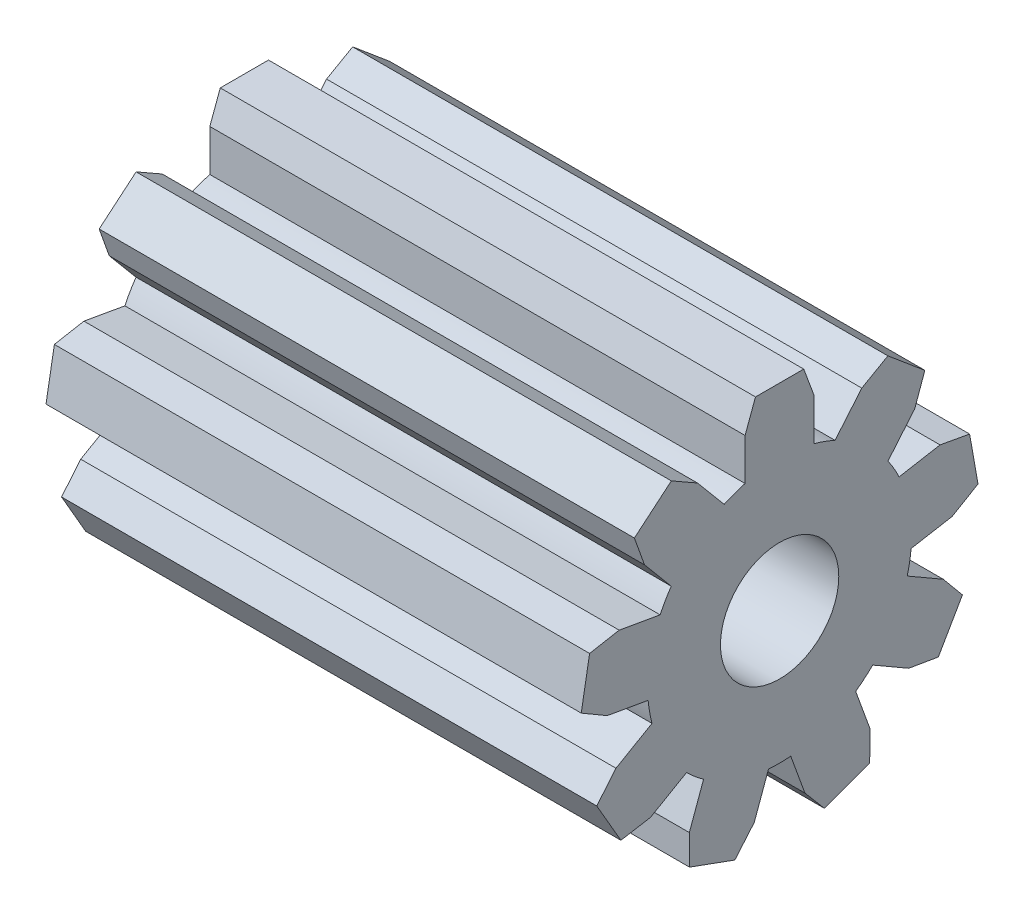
ISO-10303-21;
HEADER;
FILE_DESCRIPTION(('STEP AP214'),'2;1');
FILE_NAME('part.step','',(''),(''),'','','');
FILE_SCHEMA(('AUTOMOTIVE_DESIGN { 1 0 10303 214 1 1 1 1 }'));
ENDSEC;
DATA;
#1=APPLICATION_CONTEXT('core data for automotive mechanical design processes');
#2=APPLICATION_PROTOCOL_DEFINITION('international standard','automotive_design',2000,#1);
#3=PRODUCT_CONTEXT('',#1,'mechanical');
#4=PRODUCT('Part','Part','',(#3));
#5=PRODUCT_RELATED_PRODUCT_CATEGORY('part','',(#4));
#6=PRODUCT_DEFINITION_FORMATION('','',#4);
#7=PRODUCT_DEFINITION_CONTEXT('part definition',#1,'design');
#8=PRODUCT_DEFINITION('design','',#6,#7);
#9=PRODUCT_DEFINITION_SHAPE('','',#8);
#10=(LENGTH_UNIT() NAMED_UNIT(*) SI_UNIT(.MILLI.,.METRE.));
#11=(NAMED_UNIT(*) PLANE_ANGLE_UNIT() SI_UNIT($,.RADIAN.));
#12=(NAMED_UNIT(*) SI_UNIT($,.STERADIAN.) SOLID_ANGLE_UNIT());
#13=UNCERTAINTY_MEASURE_WITH_UNIT(LENGTH_MEASURE(1.E-05),#10,'distance_accuracy_value','');
#14=(GEOMETRIC_REPRESENTATION_CONTEXT(3) GLOBAL_UNCERTAINTY_ASSIGNED_CONTEXT((#13)) GLOBAL_UNIT_ASSIGNED_CONTEXT((#10,
#11,#12)) REPRESENTATION_CONTEXT('',''));
#15=CARTESIAN_POINT('',(0.,0.,0.));
#16=DIRECTION('',(0.,0.,1.));
#17=DIRECTION('',(1.,0.,0.));
#18=AXIS2_PLACEMENT_3D('',#15,#16,#17);
#19=CARTESIAN_POINT('',(0.,0.,0.));
#20=DIRECTION('',(1.,0.,0.));
#21=DIRECTION('',(0.,0.,-1.));
#22=AXIS2_PLACEMENT_3D('',#19,#20,#21);
#23=CYLINDRICAL_SURFACE('',#22,4.68629118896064);
#24=CARTESIAN_POINT('',(0.,0.,0.));
#25=DIRECTION('',(1.,0.,0.));
#26=DIRECTION('',(0.,0.,-1.));
#27=AXIS2_PLACEMENT_3D('',#24,#25,#26);
#28=CIRCLE('',#27,4.68629118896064);
#29=CARTESIAN_POINT('',(0.,-1.19951156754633,-4.53017627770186));
#30=VERTEX_POINT('',#29);
#31=CARTESIAN_POINT('',(0.,-0.422239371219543,-4.6672303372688));
#32=VERTEX_POINT('',#31);
#33=EDGE_CURVE('E1144',#30,#32,#28,.T.);
#34=ORIENTED_EDGE('',*,*,#33,.T.);
#35=DIRECTION('',(1.,0.,0.));
#36=VECTOR('',#35,1.);
#37=CARTESIAN_POINT('',(0.,-0.422239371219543,-4.6672303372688));
#38=LINE('',#37,#36);
#39=CARTESIAN_POINT('',(19.,-0.422239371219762,-4.66723033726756));
#40=VERTEX_POINT('',#39);
#41=EDGE_CURVE('E771',#32,#40,#38,.T.);
#42=ORIENTED_EDGE('',*,*,#41,.T.);
#43=CARTESIAN_POINT('',(19.,0.,0.));
#44=DIRECTION('',(1.,0.,0.));
#45=DIRECTION('',(0.,0.,-1.));
#46=AXIS2_PLACEMENT_3D('',#43,#44,#45);
#47=CIRCLE('',#46,4.68629118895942);
#48=CARTESIAN_POINT('',(19.,-1.1995115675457,-4.53017627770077));
#49=VERTEX_POINT('',#48);
#50=EDGE_CURVE('E1102',#49,#40,#47,.T.);
#51=ORIENTED_EDGE('',*,*,#50,.F.);
#52=DIRECTION('',(1.,0.,0.));
#53=VECTOR('',#52,1.);
#54=CARTESIAN_POINT('',(0.,-1.19951156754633,-4.53017627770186));
#55=LINE('',#54,#53);
#56=EDGE_CURVE('E785',#30,#49,#55,.T.);
#57=ORIENTED_EDGE('',*,*,#56,.F.);
#58=EDGE_LOOP('',(#34,#42,#51,#57));
#59=FACE_BOUND('',#58,.T.);
#60=ADVANCED_FACE('F339',(#59),#23,.T.);
#61=CARTESIAN_POINT('',(0.,-3.83082035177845,-2.69928519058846));
#62=VERTEX_POINT('',#61);
#63=CARTESIAN_POINT('',(0.,-3.3234919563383,-3.30389562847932));
#64=VERTEX_POINT('',#63);
#65=EDGE_CURVE('E1247',#62,#64,#28,.T.);
#66=ORIENTED_EDGE('',*,*,#65,.T.);
#67=DIRECTION('',(1.,0.,0.));
#68=VECTOR('',#67,1.);
#69=CARTESIAN_POINT('',(0.,-3.3234919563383,-3.30389562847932));
#70=LINE('',#69,#68);
#71=CARTESIAN_POINT('',(19.,-3.32349195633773,-3.30389562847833));
#72=VERTEX_POINT('',#71);
#73=EDGE_CURVE('E806',#64,#72,#70,.T.);
#74=ORIENTED_EDGE('',*,*,#73,.T.);
#75=CARTESIAN_POINT('',(19.,0.,0.));
#76=DIRECTION('',(1.,0.,0.));
#77=DIRECTION('',(0.,0.,-1.));
#78=AXIS2_PLACEMENT_3D('',#75,#76,#77);
#79=CIRCLE('',#78,4.68629118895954);
#80=CARTESIAN_POINT('',(19.,-3.83082035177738,-2.69928519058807));
#81=VERTEX_POINT('',#80);
#82=EDGE_CURVE('E1141',#81,#72,#79,.T.);
#83=ORIENTED_EDGE('',*,*,#82,.F.);
#84=DIRECTION('',(1.,0.,0.));
#85=VECTOR('',#84,1.);
#86=CARTESIAN_POINT('',(0.,-3.83082035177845,-2.69928519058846));
#87=LINE('',#86,#85);
#88=EDGE_CURVE('E821',#62,#81,#87,.T.);
#89=ORIENTED_EDGE('',*,*,#88,.F.);
#90=EDGE_LOOP('',(#66,#74,#83,#89));
#91=FACE_BOUND('',#90,.T.);
#92=ADVANCED_FACE('F1207',(#91),#23,.T.);
#93=CARTESIAN_POINT('',(0.,-4.6696457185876,0.394631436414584));
#94=VERTEX_POINT('',#93);
#95=CARTESIAN_POINT('',(0.,-4.66964571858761,-0.39463143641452));
#96=VERTEX_POINT('',#95);
#97=EDGE_CURVE('E1251',#94,#96,#28,.T.);
#98=ORIENTED_EDGE('',*,*,#97,.T.);
#99=DIRECTION('',(1.,0.,0.));
#100=VECTOR('',#99,1.);
#101=CARTESIAN_POINT('',(0.,-4.66964571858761,-0.39463143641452));
#102=LINE('',#101,#100);
#103=CARTESIAN_POINT('',(19.,-4.66964571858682,-0.394631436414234));
#104=VERTEX_POINT('',#103);
#105=EDGE_CURVE('E842',#96,#104,#102,.T.);
#106=ORIENTED_EDGE('',*,*,#105,.T.);
#107=CARTESIAN_POINT('',(19.,0.,0.));
#108=DIRECTION('',(1.,0.,0.));
#109=DIRECTION('',(0.,0.,-1.));
#110=AXIS2_PLACEMENT_3D('',#107,#108,#109);
#111=CIRCLE('',#110,4.68629118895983);
#112=CARTESIAN_POINT('',(19.,-4.66964571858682,0.394631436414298));
#113=VERTEX_POINT('',#112);
#114=EDGE_CURVE('E1136',#113,#104,#111,.T.);
#115=ORIENTED_EDGE('',*,*,#114,.F.);
#116=DIRECTION('',(1.,0.,0.));
#117=VECTOR('',#116,1.);
#118=CARTESIAN_POINT('',(0.,-4.6696457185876,0.394631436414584));
#119=LINE('',#118,#117);
#120=EDGE_CURVE('E857',#94,#113,#119,.T.);
#121=ORIENTED_EDGE('',*,*,#120,.F.);
#122=EDGE_LOOP('',(#98,#106,#115,#121));
#123=FACE_BOUND('',#122,.T.);
#124=ADVANCED_FACE('F1215',(#123),#23,.T.);
#125=CARTESIAN_POINT('',(0.,-3.32349195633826,3.30389562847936));
#126=VERTEX_POINT('',#125);
#127=CARTESIAN_POINT('',(0.,-3.83082035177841,2.69928519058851));
#128=VERTEX_POINT('',#127);
#129=EDGE_CURVE('E1255',#126,#128,#28,.T.);
#130=ORIENTED_EDGE('',*,*,#129,.T.);
#131=DIRECTION('',(1.,0.,0.));
#132=VECTOR('',#131,1.);
#133=CARTESIAN_POINT('',(0.,-3.83082035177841,2.69928519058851));
#134=LINE('',#133,#132);
#135=CARTESIAN_POINT('',(19.,-3.83082035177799,2.69928519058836));
#136=VERTEX_POINT('',#135);
#137=EDGE_CURVE('E878',#128,#136,#134,.T.);
#138=ORIENTED_EDGE('',*,*,#137,.T.);
#139=CARTESIAN_POINT('',(19.,0.,0.));
#140=DIRECTION('',(1.,0.,0.));
#141=DIRECTION('',(0.,0.,-1.));
#142=AXIS2_PLACEMENT_3D('',#139,#140,#141);
#143=CIRCLE('',#142,4.68629118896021);
#144=CARTESIAN_POINT('',(19.,-3.32349195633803,3.30389562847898));
#145=VERTEX_POINT('',#144);
#146=EDGE_CURVE('E1131',#145,#136,#143,.T.);
#147=ORIENTED_EDGE('',*,*,#146,.F.);
#148=DIRECTION('',(1.,0.,0.));
#149=VECTOR('',#148,1.);
#150=CARTESIAN_POINT('',(0.,-3.32349195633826,3.30389562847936));
#151=LINE('',#150,#149);
#152=EDGE_CURVE('E893',#126,#145,#151,.T.);
#153=ORIENTED_EDGE('',*,*,#152,.F.);
#154=EDGE_LOOP('',(#130,#138,#147,#153));
#155=FACE_BOUND('',#154,.T.);
#156=ADVANCED_FACE('F1902',(#155),#23,.T.);
#157=CARTESIAN_POINT('',(0.,-0.422239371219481,4.66723033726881));
#158=VERTEX_POINT('',#157);
#159=CARTESIAN_POINT('',(0.,-1.19951156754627,4.53017627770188));
#160=VERTEX_POINT('',#159);
#161=EDGE_CURVE('E1260',#158,#160,#28,.T.);
#162=ORIENTED_EDGE('',*,*,#161,.T.);
#163=DIRECTION('',(1.,0.,0.));
#164=VECTOR('',#163,1.);
#165=CARTESIAN_POINT('',(0.,-1.19951156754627,4.53017627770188));
#166=LINE('',#165,#164);
#167=CARTESIAN_POINT('',(19.,-1.19951156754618,4.53017627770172));
#168=VERTEX_POINT('',#167);
#169=EDGE_CURVE('E914',#160,#168,#166,.T.);
#170=ORIENTED_EDGE('',*,*,#169,.T.);
#171=CARTESIAN_POINT('',(19.,0.,0.));
#172=DIRECTION('',(1.,0.,0.));
#173=DIRECTION('',(0.,0.,-1.));
#174=AXIS2_PLACEMENT_3D('',#171,#172,#173);
#175=CIRCLE('',#174,4.68629118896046);
#176=CARTESIAN_POINT('',(19.,-0.422239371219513,4.66723033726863));
#177=VERTEX_POINT('',#176);
#178=EDGE_CURVE('E1126',#177,#168,#175,.T.);
#179=ORIENTED_EDGE('',*,*,#178,.F.);
#180=DIRECTION('',(1.,0.,0.));
#181=VECTOR('',#180,1.);
#182=CARTESIAN_POINT('',(0.,-0.422239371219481,4.66723033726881));
#183=LINE('',#182,#181);
#184=EDGE_CURVE('E929',#158,#177,#183,.T.);
#185=ORIENTED_EDGE('',*,*,#184,.F.);
#186=EDGE_LOOP('',(#162,#170,#179,#185));
#187=FACE_BOUND('',#186,.T.);
#188=ADVANCED_FACE('F1229',(#187),#23,.T.);
#189=CARTESIAN_POINT('',(0.,2.67658370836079,3.8467161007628));
#190=VERTEX_POINT('',#189);
#191=CARTESIAN_POINT('',(0.,1.9930620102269,4.24134753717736));
#192=VERTEX_POINT('',#191);
#193=EDGE_CURVE('E1265',#190,#192,#28,.T.);
#194=ORIENTED_EDGE('',*,*,#193,.T.);
#195=DIRECTION('',(1.,0.,0.));
#196=VECTOR('',#195,1.);
#197=CARTESIAN_POINT('',(0.,1.9930620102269,4.24134753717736));
#198=LINE('',#197,#196);
#199=CARTESIAN_POINT('',(19.,1.99306201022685,4.24134753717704));
#200=VERTEX_POINT('',#199);
#201=EDGE_CURVE('E950',#192,#200,#198,.T.);
#202=ORIENTED_EDGE('',*,*,#201,.T.);
#203=CARTESIAN_POINT('',(19.,0.,0.));
#204=DIRECTION('',(1.,0.,0.));
#205=DIRECTION('',(0.,0.,-1.));
#206=AXIS2_PLACEMENT_3D('',#203,#204,#205);
#207=CIRCLE('',#206,4.68629118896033);
#208=CARTESIAN_POINT('',(19.,2.67658370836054,3.84671610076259));
#209=VERTEX_POINT('',#208);
#210=EDGE_CURVE('E1121',#209,#200,#207,.T.);
#211=ORIENTED_EDGE('',*,*,#210,.F.);
#212=DIRECTION('',(1.,0.,0.));
#213=VECTOR('',#212,1.);
#214=CARTESIAN_POINT('',(0.,2.67658370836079,3.8467161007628));
#215=LINE('',#214,#213);
#216=EDGE_CURVE('E965',#190,#209,#215,.T.);
#217=ORIENTED_EDGE('',*,*,#216,.F.);
#218=EDGE_LOOP('',(#194,#202,#211,#217));
#219=FACE_BOUND('',#218,.T.);
#220=ADVANCED_FACE('F1221',(#219),#23,.T.);
#221=CARTESIAN_POINT('',(0.,4.5230035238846,1.22628064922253));
#222=VERTEX_POINT('',#221);
#223=CARTESIAN_POINT('',(0.,4.25305972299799,1.96794514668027));
#224=VERTEX_POINT('',#223);
#225=EDGE_CURVE('E1149',#222,#224,#28,.T.);
#226=ORIENTED_EDGE('',*,*,#225,.T.);
#227=DIRECTION('',(1.,0.,0.));
#228=VECTOR('',#227,1.);
#229=CARTESIAN_POINT('',(0.,4.25305972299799,1.96794514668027));
#230=LINE('',#229,#228);
#231=CARTESIAN_POINT('',(19.,4.25305972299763,1.96794514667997));
#232=VERTEX_POINT('',#231);
#233=EDGE_CURVE('E986',#224,#232,#230,.T.);
#234=ORIENTED_EDGE('',*,*,#233,.T.);
#235=CARTESIAN_POINT('',(19.,0.,0.));
#236=DIRECTION('',(1.,0.,0.));
#237=DIRECTION('',(0.,0.,-1.));
#238=AXIS2_PLACEMENT_3D('',#235,#236,#237);
#239=CIRCLE('',#238,4.68629118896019);
#240=CARTESIAN_POINT('',(19.,4.52300352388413,1.22628064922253));
#241=VERTEX_POINT('',#240);
#242=EDGE_CURVE('E1116',#241,#232,#239,.T.);
#243=ORIENTED_EDGE('',*,*,#242,.F.);
#244=DIRECTION('',(1.,0.,0.));
#245=VECTOR('',#244,1.);
#246=CARTESIAN_POINT('',(0.,4.5230035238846,1.22628064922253));
#247=LINE('',#246,#245);
#248=EDGE_CURVE('E1001',#222,#241,#247,.T.);
#249=ORIENTED_EDGE('',*,*,#248,.F.);
#250=EDGE_LOOP('',(#226,#234,#243,#249));
#251=FACE_BOUND('',#250,.T.);
#252=ADVANCED_FACE('F1210',(#251),#23,.T.);
#253=CARTESIAN_POINT('',(0.,4.25305972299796,-1.96794514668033));
#254=VERTEX_POINT('',#253);
#255=CARTESIAN_POINT('',(0.,4.5230035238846,-1.22628064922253));
#256=VERTEX_POINT('',#255);
#257=EDGE_CURVE('E1145',#254,#256,#28,.T.);
#258=ORIENTED_EDGE('',*,*,#257,.T.);
#259=DIRECTION('',(1.,0.,0.));
#260=VECTOR('',#259,1.);
#261=CARTESIAN_POINT('',(0.,4.5230035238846,-1.22628064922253));
#262=LINE('',#261,#260);
#263=CARTESIAN_POINT('',(19.,4.52300352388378,-1.22628064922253));
#264=VERTEX_POINT('',#263);
#265=EDGE_CURVE('E1022',#256,#264,#262,.T.);
#266=ORIENTED_EDGE('',*,*,#265,.T.);
#267=CARTESIAN_POINT('',(19.,0.,0.));
#268=DIRECTION('',(1.,0.,0.));
#269=DIRECTION('',(0.,0.,-1.));
#270=AXIS2_PLACEMENT_3D('',#267,#268,#269);
#271=CIRCLE('',#270,4.68629118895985);
#272=CARTESIAN_POINT('',(19.,4.25305972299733,-1.9679451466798));
#273=VERTEX_POINT('',#272);
#274=EDGE_CURVE('E1111',#273,#264,#271,.T.);
#275=ORIENTED_EDGE('',*,*,#274,.F.);
#276=DIRECTION('',(1.,0.,0.));
#277=VECTOR('',#276,1.);
#278=CARTESIAN_POINT('',(0.,4.25305972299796,-1.96794514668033));
#279=LINE('',#278,#277);
#280=EDGE_CURVE('E1068',#254,#273,#279,.T.);
#281=ORIENTED_EDGE('',*,*,#280,.F.);
#282=EDGE_LOOP('',(#258,#266,#275,#281));
#283=FACE_BOUND('',#282,.T.);
#284=ADVANCED_FACE('F1220',(#283),#23,.T.);
#285=DIRECTION('',(1.,0.,0.));
#286=VECTOR('',#285,1.);
#287=CARTESIAN_POINT('',(0.,1.99306201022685,-4.24134753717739));
#288=LINE('',#287,#286);
#289=CARTESIAN_POINT('',(0.,1.99306201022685,-4.24134753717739));
#290=VERTEX_POINT('',#289);
#291=CARTESIAN_POINT('',(19.,1.99306201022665,-4.24134753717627));
#292=VERTEX_POINT('',#291);
#293=EDGE_CURVE('E751',#290,#292,#288,.T.);
#294=ORIENTED_EDGE('',*,*,#293,.F.);
#295=CARTESIAN_POINT('',(0.,2.67658370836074,-3.84671610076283));
#296=VERTEX_POINT('',#295);
#297=EDGE_CURVE('E1148',#290,#296,#28,.T.);
#298=ORIENTED_EDGE('',*,*,#297,.T.);
#299=DIRECTION('',(1.,0.,0.));
#300=VECTOR('',#299,1.);
#301=CARTESIAN_POINT('',(0.,2.67658370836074,-3.84671610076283));
#302=LINE('',#301,#300);
#303=CARTESIAN_POINT('',(19.,2.67658370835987,-3.84671610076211));
#304=VERTEX_POINT('',#303);
#305=EDGE_CURVE('E1044',#296,#304,#302,.T.);
#306=ORIENTED_EDGE('',*,*,#305,.T.);
#307=CARTESIAN_POINT('',(19.,0.,0.));
#308=DIRECTION('',(1.,0.,0.));
#309=DIRECTION('',(0.,0.,-1.));
#310=AXIS2_PLACEMENT_3D('',#307,#308,#309);
#311=CIRCLE('',#310,4.68629118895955);
#312=EDGE_CURVE('E1107',#292,#304,#311,.T.);
#313=ORIENTED_EDGE('',*,*,#312,.F.);
#314=EDGE_LOOP('',(#294,#298,#306,#313));
#315=FACE_BOUND('',#314,.T.);
#316=ADVANCED_FACE('F1223',(#315),#23,.T.);
#317=CARTESIAN_POINT('',(0.,0.,0.));
#318=DIRECTION('',(1.,0.,0.));
#319=DIRECTION('',(0.,0.,-1.));
#320=AXIS2_PLACEMENT_3D('',#317,#318,#319);
#321=CYLINDRICAL_SURFACE('',#320,3.3);
#322=CARTESIAN_POINT('',(13.,0.,0.));
#323=DIRECTION('',(1.,0.,0.));
#324=DIRECTION('',(0.,0.,-1.));
#325=AXIS2_PLACEMENT_3D('',#322,#323,#324);
#326=CIRCLE('',#325,3.3);
#327=CARTESIAN_POINT('',(13.,3.26917420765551,-0.45));
#328=VERTEX_POINT('',#327);
#329=CARTESIAN_POINT('',(13.,-3.26917420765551,-0.45));
#330=VERTEX_POINT('',#329);
#331=EDGE_CURVE('E1097',#328,#330,#326,.F.);
#332=ORIENTED_EDGE('',*,*,#331,.F.);
#333=DIRECTION('',(1.,0.,0.));
#334=VECTOR('',#333,1.);
#335=CARTESIAN_POINT('',(0.,3.26917420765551,-0.45));
#336=LINE('',#335,#334);
#337=CARTESIAN_POINT('',(0.,3.26917420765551,-0.45));
#338=VERTEX_POINT('',#337);
#339=EDGE_CURVE('E1178',#328,#338,#336,.F.);
#340=ORIENTED_EDGE('',*,*,#339,.T.);
#341=CARTESIAN_POINT('',(0.,0.,0.));
#342=DIRECTION('',(1.,0.,0.));
#343=DIRECTION('',(0.,0.,-1.));
#344=AXIS2_PLACEMENT_3D('',#341,#342,#343);
#345=CIRCLE('',#344,3.3);
#346=CARTESIAN_POINT('',(0.,-3.26917420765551,-0.45));
#347=VERTEX_POINT('',#346);
#348=EDGE_CURVE('E354',#347,#338,#345,.T.);
#349=ORIENTED_EDGE('',*,*,#348,.F.);
#350=DIRECTION('',(1.,0.,0.));
#351=VECTOR('',#350,1.);
#352=CARTESIAN_POINT('',(0.,-3.26917420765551,-0.45));
#353=LINE('',#352,#351);
#354=EDGE_CURVE('E1176',#347,#330,#353,.T.);
#355=ORIENTED_EDGE('',*,*,#354,.T.);
#356=EDGE_LOOP('',(#332,#340,#349,#355));
#357=FACE_BOUND('',#356,.T.);
#358=ADVANCED_FACE('F1233',(#357),#321,.F.);
#359=CARTESIAN_POINT('',(13.,0.,0.));
#360=DIRECTION('',(1.,0.,0.));
#361=DIRECTION('',(0.,0.,-1.));
#362=AXIS2_PLACEMENT_3D('',#359,#360,#361);
#363=CIRCLE('',#362,3.3);
#364=CARTESIAN_POINT('',(13.,-3.26917420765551,0.45));
#365=VERTEX_POINT('',#364);
#366=CARTESIAN_POINT('',(13.,3.26917420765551,0.45));
#367=VERTEX_POINT('',#366);
#368=EDGE_CURVE('E1092',#365,#367,#363,.F.);
#369=ORIENTED_EDGE('',*,*,#368,.F.);
#370=DIRECTION('',(1.,0.,0.));
#371=VECTOR('',#370,1.);
#372=CARTESIAN_POINT('',(0.,-3.26917420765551,0.45));
#373=LINE('',#372,#371);
#374=CARTESIAN_POINT('',(0.,-3.26917420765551,0.45));
#375=VERTEX_POINT('',#374);
#376=EDGE_CURVE('E362',#365,#375,#373,.F.);
#377=ORIENTED_EDGE('',*,*,#376,.T.);
#378=CARTESIAN_POINT('',(0.,3.26917420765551,0.45));
#379=VERTEX_POINT('',#378);
#380=EDGE_CURVE('E1157',#379,#375,#345,.T.);
#381=ORIENTED_EDGE('',*,*,#380,.F.);
#382=DIRECTION('',(1.,0.,0.));
#383=VECTOR('',#382,1.);
#384=CARTESIAN_POINT('',(0.,3.26917420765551,0.45));
#385=LINE('',#384,#383);
#386=EDGE_CURVE('E1172',#379,#367,#385,.T.);
#387=ORIENTED_EDGE('',*,*,#386,.T.);
#388=EDGE_LOOP('',(#369,#377,#381,#387));
#389=FACE_BOUND('',#388,.T.);
#390=ADVANCED_FACE('F1191',(#389),#321,.F.);
#391=CARTESIAN_POINT('',(0.,-3.58015707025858,-0.45));
#392=DIRECTION('',(0.,0.,-1.));
#393=DIRECTION('',(-1.,0.,0.));
#394=AXIS2_PLACEMENT_3D('',#391,#392,#393);
#395=PLANE('',#394);
#396=DIRECTION('',(1.,0.,0.));
#397=VECTOR('',#396,1.);
#398=CARTESIAN_POINT('',(10.,2.0512191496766,-0.45));
#399=LINE('',#398,#397);
#400=CARTESIAN_POINT('',(10.,2.0512191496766,-0.45));
#401=VERTEX_POINT('',#400);
#402=CARTESIAN_POINT('',(13.,2.0512191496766,-0.45));
#403=VERTEX_POINT('',#402);
#404=EDGE_CURVE('E1077',#401,#403,#399,.T.);
#405=ORIENTED_EDGE('',*,*,#404,.F.);
#406=DIRECTION('',(0.,-1.,0.));
#407=VECTOR('',#406,1.);
#408=CARTESIAN_POINT('',(10.,-3.58015707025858,-0.45));
#409=LINE('',#408,#407);
#410=CARTESIAN_POINT('',(10.,-2.0512191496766,-0.45));
#411=VERTEX_POINT('',#410);
#412=EDGE_CURVE('E1079',#401,#411,#409,.T.);
#413=ORIENTED_EDGE('',*,*,#412,.T.);
#414=DIRECTION('',(1.,0.,0.));
#415=VECTOR('',#414,1.);
#416=CARTESIAN_POINT('',(10.,-2.0512191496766,-0.45));
#417=LINE('',#416,#415);
#418=CARTESIAN_POINT('',(13.,-2.0512191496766,-0.45));
#419=VERTEX_POINT('',#418);
#420=EDGE_CURVE('E1074',#419,#411,#417,.F.);
#421=ORIENTED_EDGE('',*,*,#420,.F.);
#422=DIRECTION('',(0.,-1.,0.));
#423=VECTOR('',#422,1.);
#424=CARTESIAN_POINT('',(13.,-3.58015707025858,-0.45));
#425=LINE('',#424,#423);
#426=EDGE_CURVE('E1094',#419,#330,#425,.T.);
#427=ORIENTED_EDGE('',*,*,#426,.T.);
#428=ORIENTED_EDGE('',*,*,#354,.F.);
#429=DIRECTION('',(0.,1.,0.));
#430=VECTOR('',#429,1.);
#431=CARTESIAN_POINT('',(0.,-3.58015707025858,-0.45));
#432=LINE('',#431,#430);
#433=EDGE_CURVE('E1150',#347,#338,#432,.T.);
#434=ORIENTED_EDGE('',*,*,#433,.T.);
#435=ORIENTED_EDGE('',*,*,#339,.F.);
#436=EDGE_CURVE('E1098',#328,#403,#425,.T.);
#437=ORIENTED_EDGE('',*,*,#436,.T.);
#438=EDGE_LOOP('',(#405,#413,#421,#427,#428,#434,#435,#437));
#439=FACE_BOUND('',#438,.T.);
#440=ADVANCED_FACE('F1476',(#439),#395,.T.);
#441=CARTESIAN_POINT('',(0.,-3.58015707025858,0.45));
#442=DIRECTION('',(0.,0.,1.));
#443=DIRECTION('',(1.,0.,0.));
#444=AXIS2_PLACEMENT_3D('',#441,#442,#443);
#445=PLANE('',#444);
#446=DIRECTION('',(1.,0.,0.));
#447=VECTOR('',#446,1.);
#448=CARTESIAN_POINT('',(10.,-2.0512191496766,0.45));
#449=LINE('',#448,#447);
#450=CARTESIAN_POINT('',(10.,-2.0512191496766,0.45));
#451=VERTEX_POINT('',#450);
#452=CARTESIAN_POINT('',(13.,-2.0512191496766,0.45));
#453=VERTEX_POINT('',#452);
#454=EDGE_CURVE('E1080',#451,#453,#449,.T.);
#455=ORIENTED_EDGE('',*,*,#454,.F.);
#456=DIRECTION('',(0.,1.,0.));
#457=VECTOR('',#456,1.);
#458=CARTESIAN_POINT('',(10.,-3.58015707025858,0.45));
#459=LINE('',#458,#457);
#460=CARTESIAN_POINT('',(10.,2.0512191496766,0.45));
#461=VERTEX_POINT('',#460);
#462=EDGE_CURVE('E12',#451,#461,#459,.T.);
#463=ORIENTED_EDGE('',*,*,#462,.T.);
#464=DIRECTION('',(1.,0.,0.));
#465=VECTOR('',#464,1.);
#466=CARTESIAN_POINT('',(10.,2.0512191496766,0.45));
#467=LINE('',#466,#465);
#468=CARTESIAN_POINT('',(13.,2.0512191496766,0.45));
#469=VERTEX_POINT('',#468);
#470=EDGE_CURVE('E1076',#469,#461,#467,.F.);
#471=ORIENTED_EDGE('',*,*,#470,.F.);
#472=DIRECTION('',(0.,1.,0.));
#473=VECTOR('',#472,1.);
#474=CARTESIAN_POINT('',(13.,-3.58015707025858,0.45));
#475=LINE('',#474,#473);
#476=EDGE_CURVE('E1179',#469,#367,#475,.T.);
#477=ORIENTED_EDGE('',*,*,#476,.T.);
#478=ORIENTED_EDGE('',*,*,#386,.F.);
#479=DIRECTION('',(0.,-1.,0.));
#480=VECTOR('',#479,1.);
#481=CARTESIAN_POINT('',(0.,-3.58015707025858,0.45));
#482=LINE('',#481,#480);
#483=EDGE_CURVE('E1153',#379,#375,#482,.T.);
#484=ORIENTED_EDGE('',*,*,#483,.T.);
#485=ORIENTED_EDGE('',*,*,#376,.F.);
#486=EDGE_CURVE('E347',#365,#453,#475,.T.);
#487=ORIENTED_EDGE('',*,*,#486,.T.);
#488=EDGE_LOOP('',(#455,#463,#471,#477,#478,#484,#485,#487));
#489=FACE_BOUND('',#488,.T.);
#490=ADVANCED_FACE('F1186',(#489),#445,.T.);
#491=CARTESIAN_POINT('',(0.,7.,0.));
#492=DIRECTION('',(0.,1.,0.));
#493=DIRECTION('',(0.,0.,1.));
#494=AXIS2_PLACEMENT_3D('',#491,#492,#493);
#495=PLANE('',#494);
#496=DIRECTION('',(0.,0.,1.));
#497=VECTOR('',#496,1.);
#498=CARTESIAN_POINT('',(0.,7.,-0.499865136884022));
#499=LINE('',#498,#497);
#500=CARTESIAN_POINT('',(0.,7.,-0.856020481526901));
#501=VERTEX_POINT('',#500);
#502=CARTESIAN_POINT('',(0.,7.,0.856020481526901));
#503=VERTEX_POINT('',#502);
#504=EDGE_CURVE('E1170',#501,#503,#499,.T.);
#505=ORIENTED_EDGE('',*,*,#504,.T.);
#506=DIRECTION('',(1.,0.,0.));
#507=VECTOR('',#506,1.);
#508=CARTESIAN_POINT('',(-3.67074236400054,7.,0.856020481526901));
#509=LINE('',#508,#507);
#510=CARTESIAN_POINT('',(19.,7.,0.856020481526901));
#511=VERTEX_POINT('',#510);
#512=EDGE_CURVE('E997',#503,#511,#509,.T.);
#513=ORIENTED_EDGE('',*,*,#512,.T.);
#514=DIRECTION('',(0.,0.,1.));
#515=VECTOR('',#514,1.);
#516=CARTESIAN_POINT('',(19.,7.,-0.499865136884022));
#517=LINE('',#516,#515);
#518=CARTESIAN_POINT('',(19.,7.,-0.856020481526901));
#519=VERTEX_POINT('',#518);
#520=EDGE_CURVE('E1114',#519,#511,#517,.T.);
#521=ORIENTED_EDGE('',*,*,#520,.F.);
#522=DIRECTION('',(1.,0.,0.));
#523=VECTOR('',#522,1.);
#524=CARTESIAN_POINT('',(-3.67074236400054,7.,-0.856020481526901));
#525=LINE('',#524,#523);
#526=EDGE_CURVE('E1019',#501,#519,#525,.T.);
#527=ORIENTED_EDGE('',*,*,#526,.F.);
#528=EDGE_LOOP('',(#505,#513,#521,#527));
#529=FACE_BOUND('',#528,.T.);
#530=ADVANCED_FACE('F1297',(#529),#495,.T.);
#531=CARTESIAN_POINT('',(0.,5.36231110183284,-4.49951326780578));
#532=DIRECTION('',(0.,0.766044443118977,-0.642787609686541));
#533=DIRECTION('',(0.,0.642787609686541,0.766044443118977));
#534=AXIS2_PLACEMENT_3D('',#531,#532,#533);
#535=PLANE('',#534);
#536=DIRECTION('',(0.,0.642787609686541,0.766044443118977));
#537=VECTOR('',#536,1.);
#538=CARTESIAN_POINT('',(0.,5.04100398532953,-4.8824321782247));
#539=LINE('',#538,#537);
#540=CARTESIAN_POINT('',(0.,4.81207174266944,-5.1552630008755));
#541=VERTEX_POINT('',#540);
#542=CARTESIAN_POINT('',(0.,5.91255046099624,-3.84376353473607));
#543=VERTEX_POINT('',#542);
#544=EDGE_CURVE('E741',#541,#543,#539,.T.);
#545=ORIENTED_EDGE('',*,*,#544,.T.);
#546=DIRECTION('',(1.,0.,0.));
#547=VECTOR('',#546,1.);
#548=CARTESIAN_POINT('',(-3.67074236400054,5.91255046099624,-3.84376353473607));
#549=LINE('',#548,#547);
#550=CARTESIAN_POINT('',(19.,5.91255046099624,-3.84376353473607));
#551=VERTEX_POINT('',#550);
#552=EDGE_CURVE('E1062',#543,#551,#549,.T.);
#553=ORIENTED_EDGE('',*,*,#552,.T.);
#554=DIRECTION('',(0.,0.64278760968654,0.766044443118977));
#555=VECTOR('',#554,1.);
#556=CARTESIAN_POINT('',(19.,5.04100398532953,-4.8824321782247));
#557=LINE('',#556,#555);
#558=CARTESIAN_POINT('',(19.,4.81207174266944,-5.1552630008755));
#559=VERTEX_POINT('',#558);
#560=EDGE_CURVE('E1109',#559,#551,#557,.T.);
#561=ORIENTED_EDGE('',*,*,#560,.F.);
#562=DIRECTION('',(1.,0.,0.));
#563=VECTOR('',#562,1.);
#564=CARTESIAN_POINT('',(-3.67074236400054,4.81207174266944,-5.1552630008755));
#565=LINE('',#564,#563);
#566=EDGE_CURVE('E1037',#541,#559,#565,.T.);
#567=ORIENTED_EDGE('',*,*,#566,.F.);
#568=EDGE_LOOP('',(#545,#553,#561,#567));
#569=FACE_BOUND('',#568,.T.);
#570=ADVANCED_FACE('F1320',(#569),#535,.T.);
#571=CARTESIAN_POINT('',(0.,1.21553724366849,-6.89365427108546));
#572=DIRECTION('',(0.,0.173648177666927,-0.984807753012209));
#573=DIRECTION('',(0.,0.984807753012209,0.173648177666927));
#574=AXIS2_PLACEMENT_3D('',#571,#572,#573);
#575=PLANE('',#574);
#576=DIRECTION('',(0.,0.984807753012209,0.173648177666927));
#577=VECTOR('',#576,1.);
#578=CARTESIAN_POINT('',(0.,0.723266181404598,-6.9804549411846));
#579=LINE('',#578,#577);
#580=CARTESIAN_POINT('',(0.,0.372521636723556,-7.04230066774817));
#581=VERTEX_POINT('',#580);
#582=CARTESIAN_POINT('',(0.,2.05855285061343,-6.74500787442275));
#583=VERTEX_POINT('',#582);
#584=EDGE_CURVE('E730',#581,#583,#579,.T.);
#585=ORIENTED_EDGE('',*,*,#584,.T.);
#586=DIRECTION('',(1.,0.,0.));
#587=VECTOR('',#586,1.);
#588=CARTESIAN_POINT('',(-3.67074236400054,2.05855285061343,-6.74500787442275));
#589=LINE('',#588,#587);
#590=CARTESIAN_POINT('',(19.,2.05855285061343,-6.74500787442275));
#591=VERTEX_POINT('',#590);
#592=EDGE_CURVE('E734',#583,#591,#589,.T.);
#593=ORIENTED_EDGE('',*,*,#592,.T.);
#594=DIRECTION('',(0.,0.984807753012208,0.173648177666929));
#595=VECTOR('',#594,1.);
#596=CARTESIAN_POINT('',(19.,0.723266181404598,-6.9804549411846));
#597=LINE('',#596,#595);
#598=CARTESIAN_POINT('',(19.,0.372521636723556,-7.04230066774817));
#599=VERTEX_POINT('',#598);
#600=EDGE_CURVE('E1105',#599,#591,#597,.T.);
#601=ORIENTED_EDGE('',*,*,#600,.F.);
#602=DIRECTION('',(1.,0.,0.));
#603=VECTOR('',#602,1.);
#604=CARTESIAN_POINT('',(-3.67074236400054,0.372521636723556,-7.04230066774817));
#605=LINE('',#604,#603);
#606=EDGE_CURVE('E737',#581,#599,#605,.T.);
#607=ORIENTED_EDGE('',*,*,#606,.F.);
#608=EDGE_LOOP('',(#585,#593,#601,#607));
#609=FACE_BOUND('',#608,.T.);
#610=ADVANCED_FACE('F732',(#609),#575,.T.);
#611=CARTESIAN_POINT('',(0.,-3.50000000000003,-6.06217782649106));
#612=DIRECTION('',(0.,-0.500000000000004,-0.866025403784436));
#613=DIRECTION('',(0.,0.866025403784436,-0.500000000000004));
#614=AXIS2_PLACEMENT_3D('',#611,#612,#613);
#615=PLANE('',#614);
#616=DIRECTION('',(0.,0.866025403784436,-0.500000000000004));
#617=VECTOR('',#616,1.);
#618=CARTESIAN_POINT('',(0.,-3.93289590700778,-5.81224525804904));
#619=LINE('',#618,#617);
#620=CARTESIAN_POINT('',(0.,-4.24133548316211,-5.6341675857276));
#621=VERTEX_POINT('',#620);
#622=CARTESIAN_POINT('',(0.,-2.75866451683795,-6.49018806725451));
#623=VERTEX_POINT('',#622);
#624=EDGE_CURVE('E742',#621,#623,#619,.T.);
#625=ORIENTED_EDGE('',*,*,#624,.T.);
#626=DIRECTION('',(1.,0.,0.));
#627=VECTOR('',#626,1.);
#628=CARTESIAN_POINT('',(-3.67074236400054,-2.75866451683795,-6.49018806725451));
#629=LINE('',#628,#627);
#630=CARTESIAN_POINT('',(19.,-2.75866451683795,-6.49018806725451));
#631=VERTEX_POINT('',#630);
#632=EDGE_CURVE('E781',#623,#631,#629,.T.);
#633=ORIENTED_EDGE('',*,*,#632,.T.);
#634=DIRECTION('',(0.,0.866025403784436,-0.500000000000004));
#635=VECTOR('',#634,1.);
#636=CARTESIAN_POINT('',(19.,-3.93289590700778,-5.81224525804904));
#637=LINE('',#636,#635);
#638=CARTESIAN_POINT('',(19.,-4.24133548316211,-5.6341675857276));
#639=VERTEX_POINT('',#638);
#640=EDGE_CURVE('E1100',#639,#631,#637,.T.);
#641=ORIENTED_EDGE('',*,*,#640,.F.);
#642=DIRECTION('',(1.,0.,0.));
#643=VECTOR('',#642,1.);
#644=CARTESIAN_POINT('',(-3.67074236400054,-4.24133548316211,-5.6341675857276));
#645=LINE('',#644,#643);
#646=EDGE_CURVE('E803',#621,#639,#645,.T.);
#647=ORIENTED_EDGE('',*,*,#646,.F.);
#648=EDGE_LOOP('',(#625,#633,#641,#647));
#649=FACE_BOUND('',#648,.T.);
#650=ADVANCED_FACE('F1502',(#649),#615,.T.);
#651=CARTESIAN_POINT('',(0.,-6.57784834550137,-2.39414100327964));
#652=DIRECTION('',(0.,-0.939692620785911,-0.342020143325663));
#653=DIRECTION('',(0.,0.342020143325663,-0.939692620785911));
#654=AXIS2_PLACEMENT_3D('',#651,#652,#653);
#655=PLANE('',#654);
#656=DIRECTION('',(0.,0.342020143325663,-0.939692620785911));
#657=VECTOR('',#656,1.);
#658=CARTESIAN_POINT('',(0.,-6.74881229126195,-1.92442142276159));
#659=LINE('',#658,#657);
#660=CARTESIAN_POINT('',(0.,-6.87062459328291,-1.58974487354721));
#661=VERTEX_POINT('',#660);
#662=CARTESIAN_POINT('',(0.,-6.28507209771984,-3.19853713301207));
#663=VERTEX_POINT('',#662);
#664=EDGE_CURVE('E1166',#661,#663,#659,.T.);
#665=ORIENTED_EDGE('',*,*,#664,.T.);
#666=DIRECTION('',(1.,0.,0.));
#667=VECTOR('',#666,1.);
#668=CARTESIAN_POINT('',(-3.67074236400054,-6.28507209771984,-3.19853713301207));
#669=LINE('',#668,#667);
#670=CARTESIAN_POINT('',(19.,-6.28507209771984,-3.19853713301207));
#671=VERTEX_POINT('',#670);
#672=EDGE_CURVE('E817',#663,#671,#669,.T.);
#673=ORIENTED_EDGE('',*,*,#672,.T.);
#674=DIRECTION('',(0.,0.342020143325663,-0.939692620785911));
#675=VECTOR('',#674,1.);
#676=CARTESIAN_POINT('',(19.,-6.74881229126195,-1.92442142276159));
#677=LINE('',#676,#675);
#678=CARTESIAN_POINT('',(19.,-6.87062459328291,-1.58974487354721));
#679=VERTEX_POINT('',#678);
#680=EDGE_CURVE('E1139',#679,#671,#677,.T.);
#681=ORIENTED_EDGE('',*,*,#680,.F.);
#682=DIRECTION('',(1.,0.,0.));
#683=VECTOR('',#682,1.);
#684=CARTESIAN_POINT('',(-3.67074236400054,-6.87062459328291,-1.58974487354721));
#685=LINE('',#684,#683);
#686=EDGE_CURVE('E839',#661,#679,#685,.T.);
#687=ORIENTED_EDGE('',*,*,#686,.F.);
#688=EDGE_LOOP('',(#665,#673,#681,#687));
#689=FACE_BOUND('',#688,.T.);
#690=ADVANCED_FACE('F1498',(#689),#655,.T.);
#691=CARTESIAN_POINT('',(0.,-6.57784834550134,2.39414100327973));
#692=DIRECTION('',(0.,-0.939692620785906,0.342020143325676));
#693=DIRECTION('',(0.,-0.342020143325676,-0.939692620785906));
#694=AXIS2_PLACEMENT_3D('',#691,#692,#693);
#695=PLANE('',#694);
#696=DIRECTION('',(0.,-0.342020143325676,-0.939692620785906));
#697=VECTOR('',#696,1.);
#698=CARTESIAN_POINT('',(0.,-6.40688439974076,2.86386058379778));
#699=LINE('',#698,#697);
#700=CARTESIAN_POINT('',(0.,-6.2850720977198,3.19853713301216));
#701=VERTEX_POINT('',#700);
#702=CARTESIAN_POINT('',(0.,-6.87062459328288,1.5897448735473));
#703=VERTEX_POINT('',#702);
#704=EDGE_CURVE('E1164',#701,#703,#699,.T.);
#705=ORIENTED_EDGE('',*,*,#704,.T.);
#706=DIRECTION('',(1.,0.,0.));
#707=VECTOR('',#706,1.);
#708=CARTESIAN_POINT('',(-3.67074236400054,-6.87062459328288,1.5897448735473));
#709=LINE('',#708,#707);
#710=CARTESIAN_POINT('',(19.,-6.87062459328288,1.5897448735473));
#711=VERTEX_POINT('',#710);
#712=EDGE_CURVE('E853',#703,#711,#709,.T.);
#713=ORIENTED_EDGE('',*,*,#712,.T.);
#714=DIRECTION('',(0.,-0.342020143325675,-0.939692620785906));
#715=VECTOR('',#714,1.);
#716=CARTESIAN_POINT('',(19.,-6.40688439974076,2.86386058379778));
#717=LINE('',#716,#715);
#718=CARTESIAN_POINT('',(19.,-6.2850720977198,3.19853713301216));
#719=VERTEX_POINT('',#718);
#720=EDGE_CURVE('E1134',#719,#711,#717,.T.);
#721=ORIENTED_EDGE('',*,*,#720,.F.);
#722=DIRECTION('',(1.,0.,0.));
#723=VECTOR('',#722,1.);
#724=CARTESIAN_POINT('',(-3.67074236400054,-6.2850720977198,3.19853713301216));
#725=LINE('',#724,#723);
#726=EDGE_CURVE('E875',#701,#719,#725,.T.);
#727=ORIENTED_EDGE('',*,*,#726,.F.);
#728=EDGE_LOOP('',(#705,#713,#721,#727));
#729=FACE_BOUND('',#728,.T.);
#730=ADVANCED_FACE('F1494',(#729),#695,.T.);
#731=CARTESIAN_POINT('',(0.,-3.49999999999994,6.0621778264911));
#732=DIRECTION('',(0.,-0.499999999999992,0.866025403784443));
#733=DIRECTION('',(0.,-0.866025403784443,-0.499999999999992));
#734=AXIS2_PLACEMENT_3D('',#731,#732,#733);
#735=PLANE('',#734);
#736=DIRECTION('',(0.,-0.866025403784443,-0.499999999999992));
#737=VECTOR('',#736,1.);
#738=CARTESIAN_POINT('',(0.,-3.06710409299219,6.31211039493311));
#739=LINE('',#738,#737);
#740=CARTESIAN_POINT('',(0.,-2.75866451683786,6.49018806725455));
#741=VERTEX_POINT('',#740);
#742=CARTESIAN_POINT('',(0.,-4.24133548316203,5.63416758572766));
#743=VERTEX_POINT('',#742);
#744=EDGE_CURVE('E1162',#741,#743,#739,.T.);
#745=ORIENTED_EDGE('',*,*,#744,.T.);
#746=DIRECTION('',(1.,0.,0.));
#747=VECTOR('',#746,1.);
#748=CARTESIAN_POINT('',(-3.67074236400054,-4.24133548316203,5.63416758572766));
#749=LINE('',#748,#747);
#750=CARTESIAN_POINT('',(19.,-4.24133548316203,5.63416758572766));
#751=VERTEX_POINT('',#750);
#752=EDGE_CURVE('E889',#743,#751,#749,.T.);
#753=ORIENTED_EDGE('',*,*,#752,.T.);
#754=DIRECTION('',(0.,-0.866025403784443,-0.499999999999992));
#755=VECTOR('',#754,1.);
#756=CARTESIAN_POINT('',(19.,-3.06710409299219,6.31211039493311));
#757=LINE('',#756,#755);
#758=CARTESIAN_POINT('',(19.,-2.75866451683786,6.49018806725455));
#759=VERTEX_POINT('',#758);
#760=EDGE_CURVE('E1129',#759,#751,#757,.T.);
#761=ORIENTED_EDGE('',*,*,#760,.F.);
#762=DIRECTION('',(1.,0.,0.));
#763=VECTOR('',#762,1.);
#764=CARTESIAN_POINT('',(-3.67074236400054,-2.75866451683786,6.49018806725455));
#765=LINE('',#764,#763);
#766=EDGE_CURVE('E911',#741,#759,#765,.T.);
#767=ORIENTED_EDGE('',*,*,#766,.F.);
#768=EDGE_LOOP('',(#745,#753,#761,#767));
#769=FACE_BOUND('',#768,.T.);
#770=ADVANCED_FACE('F1490',(#769),#735,.T.);
#771=CARTESIAN_POINT('',(0.,1.21553724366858,6.89365427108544));
#772=DIRECTION('',(0.,0.17364817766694,0.984807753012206));
#773=DIRECTION('',(0.,-0.984807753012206,0.17364817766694));
#774=AXIS2_PLACEMENT_3D('',#771,#772,#773);
#775=PLANE('',#774);
#776=DIRECTION('',(0.,-0.984807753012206,0.17364817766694));
#777=VECTOR('',#776,1.);
#778=CARTESIAN_POINT('',(0.,1.70780830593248,6.8068536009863));
#779=LINE('',#778,#777);
#780=CARTESIAN_POINT('',(0.,2.05855285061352,6.74500787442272));
#781=VERTEX_POINT('',#780);
#782=CARTESIAN_POINT('',(0.,0.372521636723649,7.04230066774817));
#783=VERTEX_POINT('',#782);
#784=EDGE_CURVE('E1160',#781,#783,#779,.T.);
#785=ORIENTED_EDGE('',*,*,#784,.T.);
#786=DIRECTION('',(1.,0.,0.));
#787=VECTOR('',#786,1.);
#788=CARTESIAN_POINT('',(-3.67074236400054,0.372521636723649,7.04230066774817));
#789=LINE('',#788,#787);
#790=CARTESIAN_POINT('',(19.,0.372521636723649,7.04230066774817));
#791=VERTEX_POINT('',#790);
#792=EDGE_CURVE('E925',#783,#791,#789,.T.);
#793=ORIENTED_EDGE('',*,*,#792,.T.);
#794=DIRECTION('',(0.,-0.984807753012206,0.17364817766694));
#795=VECTOR('',#794,1.);
#796=CARTESIAN_POINT('',(19.,1.70780830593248,6.8068536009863));
#797=LINE('',#796,#795);
#798=CARTESIAN_POINT('',(19.,2.05855285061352,6.74500787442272));
#799=VERTEX_POINT('',#798);
#800=EDGE_CURVE('E1124',#799,#791,#797,.T.);
#801=ORIENTED_EDGE('',*,*,#800,.F.);
#802=DIRECTION('',(1.,0.,0.));
#803=VECTOR('',#802,1.);
#804=CARTESIAN_POINT('',(-3.67074236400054,2.05855285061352,6.74500787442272));
#805=LINE('',#804,#803);
#806=EDGE_CURVE('E947',#781,#799,#805,.T.);
#807=ORIENTED_EDGE('',*,*,#806,.F.);
#808=EDGE_LOOP('',(#785,#793,#801,#807));
#809=FACE_BOUND('',#808,.T.);
#810=ADVANCED_FACE('F1203',(#809),#775,.T.);
#811=CARTESIAN_POINT('',(0.,5.3623111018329,4.49951326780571));
#812=DIRECTION('',(0.,0.766044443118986,0.64278760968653));
#813=DIRECTION('',(0.,-0.64278760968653,0.766044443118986));
#814=AXIS2_PLACEMENT_3D('',#811,#812,#813);
#815=PLANE('',#814);
#816=DIRECTION('',(0.,-0.64278760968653,0.766044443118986));
#817=VECTOR('',#816,1.);
#818=CARTESIAN_POINT('',(0.,5.68361821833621,4.11659435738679));
#819=LINE('',#818,#817);
#820=CARTESIAN_POINT('',(0.,5.91255046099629,3.84376353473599));
#821=VERTEX_POINT('',#820);
#822=CARTESIAN_POINT('',(0.,4.81207174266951,5.15526300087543));
#823=VERTEX_POINT('',#822);
#824=EDGE_CURVE('E1158',#821,#823,#819,.T.);
#825=ORIENTED_EDGE('',*,*,#824,.T.);
#826=DIRECTION('',(1.,0.,0.));
#827=VECTOR('',#826,1.);
#828=CARTESIAN_POINT('',(-3.67074236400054,4.81207174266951,5.15526300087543));
#829=LINE('',#828,#827);
#830=CARTESIAN_POINT('',(19.,4.81207174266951,5.15526300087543));
#831=VERTEX_POINT('',#830);
#832=EDGE_CURVE('E961',#823,#831,#829,.T.);
#833=ORIENTED_EDGE('',*,*,#832,.T.);
#834=DIRECTION('',(0.,-0.642787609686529,0.766044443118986));
#835=VECTOR('',#834,1.);
#836=CARTESIAN_POINT('',(19.,5.68361821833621,4.11659435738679));
#837=LINE('',#836,#835);
#838=CARTESIAN_POINT('',(19.,5.91255046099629,3.84376353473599));
#839=VERTEX_POINT('',#838);
#840=EDGE_CURVE('E1119',#839,#831,#837,.T.);
#841=ORIENTED_EDGE('',*,*,#840,.F.);
#842=DIRECTION('',(1.,0.,0.));
#843=VECTOR('',#842,1.);
#844=CARTESIAN_POINT('',(-3.67074236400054,5.91255046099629,3.84376353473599));
#845=LINE('',#844,#843);
#846=EDGE_CURVE('E983',#821,#839,#845,.T.);
#847=ORIENTED_EDGE('',*,*,#846,.F.);
#848=EDGE_LOOP('',(#825,#833,#841,#847));
#849=FACE_BOUND('',#848,.T.);
#850=ADVANCED_FACE('F1196',(#849),#815,.T.);
#851=CARTESIAN_POINT('',(0.,3.91481996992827,1.42487794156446));
#852=DIRECTION('',(1.,0.,0.));
#853=DIRECTION('',(0.,0.,-1.));
#854=AXIS2_PLACEMENT_3D('',#851,#852,#853);
#855=PLANE('',#854);
#856=ORIENTED_EDGE('',*,*,#297,.F.);
#857=DIRECTION('',(0.,0.173648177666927,-0.984807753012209));
#858=VECTOR('',#857,1.);
#859=CARTESIAN_POINT('',(0.,1.20765069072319,0.212941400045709));
#860=LINE('',#859,#858);
#861=CARTESIAN_POINT('',(0.,2.24953975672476,-5.69590511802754));
#862=VERTEX_POINT('',#861);
#863=EDGE_CURVE('E748',#290,#862,#860,.T.);
#864=ORIENTED_EDGE('',*,*,#863,.T.);
#865=DIRECTION('',(0.,-0.179104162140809,-0.983830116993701));
#866=VECTOR('',#865,1.);
#867=CARTESIAN_POINT('',(0.,3.18104278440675,-0.579102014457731));
#868=LINE('',#867,#866);
#869=EDGE_CURVE('E745',#862,#583,#868,.T.);
#870=ORIENTED_EDGE('',*,*,#869,.T.);
#871=ORIENTED_EDGE('',*,*,#584,.F.);
#872=DIRECTION('',(0.,0.504792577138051,-0.863240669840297));
#873=VECTOR('',#872,1.);
#874=CARTESIAN_POINT('',(0.,-2.79113787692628,-1.63215859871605));
#875=LINE('',#874,#873);
#876=CARTESIAN_POINT('',(0.,-0.165761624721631,-6.12178791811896));
#877=VERTEX_POINT('',#876);
#878=EDGE_CURVE('E769',#877,#581,#875,.T.);
#879=ORIENTED_EDGE('',*,*,#878,.F.);
#880=DIRECTION('',(0.,0.173648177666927,-0.984807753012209));
#881=VECTOR('',#880,1.);
#882=CARTESIAN_POINT('',(0.,-1.2076506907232,-0.21294140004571));
#883=LINE('',#882,#881);
#884=EDGE_CURVE('E767',#32,#877,#883,.T.);
#885=ORIENTED_EDGE('',*,*,#884,.F.);
#886=ORIENTED_EDGE('',*,*,#33,.F.);
#887=DIRECTION('',(0.,-0.500000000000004,-0.866025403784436));
#888=VECTOR('',#887,1.);
#889=CARTESIAN_POINT('',(0.,1.06199019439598,-0.613140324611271));
#890=LINE('',#889,#888);
#891=CARTESIAN_POINT('',(0.,-1.93800980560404,-5.80929274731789));
#892=VERTEX_POINT('',#891);
#893=EDGE_CURVE('E786',#30,#892,#890,.T.);
#894=ORIENTED_EDGE('',*,*,#893,.T.);
#895=DIRECTION('',(0.,-0.769595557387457,-0.638531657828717));
#896=VECTOR('',#895,1.);
#897=CARTESIAN_POINT('',(0.,2.06458054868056,-2.48835276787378));
#898=LINE('',#897,#896);
#899=EDGE_CURVE('E782',#892,#623,#898,.T.);
#900=ORIENTED_EDGE('',*,*,#899,.T.);
#901=ORIENTED_EDGE('',*,*,#624,.F.);
#902=DIRECTION('',(0.,-0.168186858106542,-0.98575513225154));
#903=VECTOR('',#902,1.);
#904=CARTESIAN_POINT('',(0.,-3.1872669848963,0.543802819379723));
#905=LINE('',#904,#903);
#906=CARTESIAN_POINT('',(0.,-4.06199019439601,-4.58301209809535));
#907=VERTEX_POINT('',#906);
#908=EDGE_CURVE('E802',#907,#621,#905,.T.);
#909=ORIENTED_EDGE('',*,*,#908,.F.);
#910=DIRECTION('',(0.,-0.500000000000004,-0.866025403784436));
#911=VECTOR('',#910,1.);
#912=CARTESIAN_POINT('',(0.,-1.06199019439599,0.613140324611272));
#913=LINE('',#912,#911);
#914=EDGE_CURVE('E800',#64,#907,#913,.T.);
#915=ORIENTED_EDGE('',*,*,#914,.F.);
#916=ORIENTED_EDGE('',*,*,#65,.F.);
#917=DIRECTION('',(0.,-0.93969262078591,-0.342020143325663));
#918=VECTOR('',#917,1.);
#919=CARTESIAN_POINT('',(0.,0.419412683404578,-1.15232687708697));
#920=LINE('',#919,#918);
#921=CARTESIAN_POINT('',(0.,-5.21874304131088,-3.20444773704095));
#922=VERTEX_POINT('',#921);
#923=EDGE_CURVE('E822',#62,#922,#920,.T.);
#924=ORIENTED_EDGE('',*,*,#923,.T.);
#925=DIRECTION('',(0.,-0.999984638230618,0.00554286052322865));
#926=VECTOR('',#925,1.);
#927=CARTESIAN_POINT('',(0.,-0.0179218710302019,-3.23327560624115));
#928=LINE('',#927,#926);
#929=EDGE_CURVE('E818',#922,#663,#928,.T.);
#930=ORIENTED_EDGE('',*,*,#929,.T.);
#931=ORIENTED_EDGE('',*,*,#664,.F.);
#932=DIRECTION('',(0.,-0.762469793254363,-0.647023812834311));
#933=VECTOR('',#932,1.);
#934=CARTESIAN_POINT('',(0.,-2.09203844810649,2.46531285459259));
#935=LINE('',#934,#933);
#936=CARTESIAN_POINT('',(0.,-6.05756840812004,-0.899793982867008));
#937=VERTEX_POINT('',#936);
#938=EDGE_CURVE('E838',#937,#661,#935,.T.);
#939=ORIENTED_EDGE('',*,*,#938,.F.);
#940=DIRECTION('',(0.,-0.93969262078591,-0.342020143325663));
#941=VECTOR('',#940,1.);
#942=CARTESIAN_POINT('',(0.,-0.419412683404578,1.15232687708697));
#943=LINE('',#942,#941);
#944=EDGE_CURVE('E836',#96,#937,#943,.T.);
#945=ORIENTED_EDGE('',*,*,#944,.F.);
#946=ORIENTED_EDGE('',*,*,#97,.F.);
#947=DIRECTION('',(0.,-0.939692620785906,0.342020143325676));
#948=VECTOR('',#947,1.);
#949=CARTESIAN_POINT('',(0.,-0.419412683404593,-1.15232687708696));
#950=LINE('',#949,#948);
#951=CARTESIAN_POINT('',(0.,-6.05756840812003,0.89979398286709));
#952=VERTEX_POINT('',#951);
#953=EDGE_CURVE('E858',#94,#952,#950,.T.);
#954=ORIENTED_EDGE('',*,*,#953,.T.);
#955=DIRECTION('',(0.,-0.762469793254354,0.647023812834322));
#956=VECTOR('',#955,1.);
#957=CARTESIAN_POINT('',(0.,-2.09203844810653,-2.46531285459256));
#958=LINE('',#957,#956);
#959=EDGE_CURVE('E854',#952,#703,#958,.T.);
#960=ORIENTED_EDGE('',*,*,#959,.T.);
#961=ORIENTED_EDGE('',*,*,#704,.F.);
#962=DIRECTION('',(0.,-0.999984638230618,-0.00554286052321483));
#963=VECTOR('',#962,1.);
#964=CARTESIAN_POINT('',(0.,-0.0179218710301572,3.23327560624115));
#965=LINE('',#964,#963);
#966=CARTESIAN_POINT('',(0.,-5.21874304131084,3.20444773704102));
#967=VERTEX_POINT('',#966);
#968=EDGE_CURVE('E874',#967,#701,#965,.T.);
#969=ORIENTED_EDGE('',*,*,#968,.F.);
#970=DIRECTION('',(0.,-0.939692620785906,0.342020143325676));
#971=VECTOR('',#970,1.);
#972=CARTESIAN_POINT('',(0.,0.419412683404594,1.15232687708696));
#973=LINE('',#972,#971);
#974=EDGE_CURVE('E872',#128,#967,#973,.T.);
#975=ORIENTED_EDGE('',*,*,#974,.F.);
#976=ORIENTED_EDGE('',*,*,#129,.F.);
#977=DIRECTION('',(0.,-0.499999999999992,0.866025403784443));
#978=VECTOR('',#977,1.);
#979=CARTESIAN_POINT('',(0.,-1.06199019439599,-0.613140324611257));
#980=LINE('',#979,#978);
#981=CARTESIAN_POINT('',(0.,-4.06199019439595,4.5830120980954));
#982=VERTEX_POINT('',#981);
#983=EDGE_CURVE('E894',#126,#982,#980,.T.);
#984=ORIENTED_EDGE('',*,*,#983,.T.);
#985=DIRECTION('',(0.,-0.168186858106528,0.985755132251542));
#986=VECTOR('',#985,1.);
#987=CARTESIAN_POINT('',(0.,-3.1872669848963,-0.543802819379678));
#988=LINE('',#987,#986);
#989=EDGE_CURVE('E890',#982,#743,#988,.T.);
#990=ORIENTED_EDGE('',*,*,#989,.T.);
#991=ORIENTED_EDGE('',*,*,#744,.F.);
#992=DIRECTION('',(0.,-0.769595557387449,0.638531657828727));
#993=VECTOR('',#992,1.);
#994=CARTESIAN_POINT('',(0.,2.0645805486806,2.48835276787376));
#995=LINE('',#994,#993);
#996=CARTESIAN_POINT('',(0.,-1.93800980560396,5.80929274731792));
#997=VERTEX_POINT('',#996);
#998=EDGE_CURVE('E910',#997,#741,#995,.T.);
#999=ORIENTED_EDGE('',*,*,#998,.F.);
#1000=DIRECTION('',(0.,-0.499999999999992,0.866025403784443));
#1001=VECTOR('',#1000,1.);
#1002=CARTESIAN_POINT('',(0.,1.06199019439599,0.613140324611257));
#1003=LINE('',#1002,#1001);
#1004=EDGE_CURVE('E908',#160,#997,#1003,.T.);
#1005=ORIENTED_EDGE('',*,*,#1004,.F.);
#1006=ORIENTED_EDGE('',*,*,#161,.F.);
#1007=DIRECTION('',(0.,0.17364817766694,0.984807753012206));
#1008=VECTOR('',#1007,1.);
#1009=CARTESIAN_POINT('',(0.,-1.20765069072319,0.212941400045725));
#1010=LINE('',#1009,#1008);
#1011=CARTESIAN_POINT('',(0.,-0.165761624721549,6.12178791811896));
#1012=VERTEX_POINT('',#1011);
#1013=EDGE_CURVE('E930',#158,#1012,#1010,.T.);
#1014=ORIENTED_EDGE('',*,*,#1013,.T.);
#1015=DIRECTION('',(0.,0.504792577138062,0.863240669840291));
#1016=VECTOR('',#1015,1.);
#1017=CARTESIAN_POINT('',(0.,-2.79113787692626,1.63215859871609));
#1018=LINE('',#1017,#1016);
#1019=EDGE_CURVE('E926',#1012,#783,#1018,.T.);
#1020=ORIENTED_EDGE('',*,*,#1019,.T.);
#1021=ORIENTED_EDGE('',*,*,#784,.F.);
#1022=DIRECTION('',(0.,-0.179104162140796,0.983830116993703));
#1023=VECTOR('',#1022,1.);
#1024=CARTESIAN_POINT('',(0.,3.18104278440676,0.57910201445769));
#1025=LINE('',#1024,#1023);
#1026=CARTESIAN_POINT('',(0.,2.24953975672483,5.69590511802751));
#1027=VERTEX_POINT('',#1026);
#1028=EDGE_CURVE('E946',#1027,#781,#1025,.T.);
#1029=ORIENTED_EDGE('',*,*,#1028,.F.);
#1030=DIRECTION('',(0.,0.173648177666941,0.984807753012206));
#1031=VECTOR('',#1030,1.);
#1032=CARTESIAN_POINT('',(0.,1.20765069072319,-0.212941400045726));
#1033=LINE('',#1032,#1031);
#1034=EDGE_CURVE('E944',#192,#1027,#1033,.T.);
#1035=ORIENTED_EDGE('',*,*,#1034,.F.);
#1036=ORIENTED_EDGE('',*,*,#193,.F.);
#1037=DIRECTION('',(0.,0.766044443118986,0.64278760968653));
#1038=VECTOR('',#1037,1.);
#1039=CARTESIAN_POINT('',(0.,-0.788238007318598,0.939385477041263));
#1040=LINE('',#1039,#1038);
#1041=CARTESIAN_POINT('',(0.,3.80802865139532,4.79611113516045));
#1042=VERTEX_POINT('',#1041);
#1043=EDGE_CURVE('E966',#190,#1042,#1040,.T.);
#1044=ORIENTED_EDGE('',*,*,#1043,.T.);
#1045=DIRECTION('',(0.,0.941573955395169,0.336806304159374));
#1046=VECTOR('',#1045,1.);
#1047=CARTESIAN_POINT('',(0.,-1.08900433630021,3.04441486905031));
#1048=LINE('',#1047,#1046);
#1049=EDGE_CURVE('E962',#1042,#823,#1048,.T.);
#1050=ORIENTED_EDGE('',*,*,#1049,.T.);
#1051=ORIENTED_EDGE('',*,*,#824,.F.);
#1052=DIRECTION('',(0.,0.495192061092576,0.868783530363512));
#1053=VECTOR('',#1052,1.);
#1054=CARTESIAN_POINT('',(0.,2.80905974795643,-1.60111700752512));
#1055=LINE('',#1054,#1053);
#1056=CARTESIAN_POINT('',(0.,5.38450466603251,2.91734018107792));
#1057=VERTEX_POINT('',#1056);
#1058=EDGE_CURVE('E982',#1057,#821,#1055,.T.);
#1059=ORIENTED_EDGE('',*,*,#1058,.F.);
#1060=DIRECTION('',(0.,0.766044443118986,0.64278760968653));
#1061=VECTOR('',#1060,1.);
#1062=CARTESIAN_POINT('',(0.,0.788238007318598,-0.939385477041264));
#1063=LINE('',#1062,#1061);
#1064=EDGE_CURVE('E980',#224,#1057,#1063,.T.);
#1065=ORIENTED_EDGE('',*,*,#1064,.F.);
#1066=ORIENTED_EDGE('',*,*,#225,.F.);
#1067=DIRECTION('',(0.,1.,0.));
#1068=VECTOR('',#1067,1.);
#1069=CARTESIAN_POINT('',(0.,0.,1.22628064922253));
#1070=LINE('',#1069,#1068);
#1071=CARTESIAN_POINT('',(0.,6.,1.22628064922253));
#1072=VERTEX_POINT('',#1071);
#1073=EDGE_CURVE('E1002',#222,#1072,#1070,.T.);
#1074=ORIENTED_EDGE('',*,*,#1073,.T.);
#1075=DIRECTION('',(0.,0.937782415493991,-0.34722347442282));
#1076=VECTOR('',#1075,1.);
#1077=CARTESIAN_POINT('',(0.,1.12268643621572,3.03215558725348));
#1078=LINE('',#1077,#1076);
#1079=EDGE_CURVE('E998',#1072,#503,#1078,.T.);
#1080=ORIENTED_EDGE('',*,*,#1079,.T.);
#1081=ORIENTED_EDGE('',*,*,#504,.F.);
#1082=DIRECTION('',(0.,0.937782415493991,0.34722347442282));
#1083=VECTOR('',#1082,1.);
#1084=CARTESIAN_POINT('',(0.,1.12268643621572,-3.03215558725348));
#1085=LINE('',#1084,#1083);
#1086=CARTESIAN_POINT('',(0.,6.,-1.22628064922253));
#1087=VERTEX_POINT('',#1086);
#1088=EDGE_CURVE('E1018',#1087,#501,#1085,.T.);
#1089=ORIENTED_EDGE('',*,*,#1088,.F.);
#1090=DIRECTION('',(0.,1.,0.));
#1091=VECTOR('',#1090,1.);
#1092=CARTESIAN_POINT('',(0.,0.,-1.22628064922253));
#1093=LINE('',#1092,#1091);
#1094=EDGE_CURVE('E1016',#256,#1087,#1093,.T.);
#1095=ORIENTED_EDGE('',*,*,#1094,.F.);
#1096=ORIENTED_EDGE('',*,*,#257,.F.);
#1097=DIRECTION('',(0.,0.766044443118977,-0.64278760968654));
#1098=VECTOR('',#1097,1.);
#1099=CARTESIAN_POINT('',(0.,0.788238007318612,0.939385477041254));
#1100=LINE('',#1099,#1098);
#1101=CARTESIAN_POINT('',(0.,5.38450466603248,-2.91734018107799));
#1102=VERTEX_POINT('',#1101);
#1103=EDGE_CURVE('E1053',#254,#1102,#1100,.T.);
#1104=ORIENTED_EDGE('',*,*,#1103,.T.);
#1105=DIRECTION('',(0.,0.495192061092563,-0.868783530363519));
#1106=VECTOR('',#1105,1.);
#1107=CARTESIAN_POINT('',(0.,2.80905974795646,1.60111700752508));
#1108=LINE('',#1107,#1106);
#1109=EDGE_CURVE('E1055',#1102,#543,#1108,.T.);
#1110=ORIENTED_EDGE('',*,*,#1109,.T.);
#1111=ORIENTED_EDGE('',*,*,#544,.F.);
#1112=DIRECTION('',(0.,0.941573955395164,-0.336806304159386));
#1113=VECTOR('',#1112,1.);
#1114=CARTESIAN_POINT('',(0.,-1.08900433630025,-3.0444148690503));
#1115=LINE('',#1114,#1113);
#1116=CARTESIAN_POINT('',(0.,3.80802865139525,-4.79611113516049));
#1117=VERTEX_POINT('',#1116);
#1118=EDGE_CURVE('E1041',#1117,#541,#1115,.T.);
#1119=ORIENTED_EDGE('',*,*,#1118,.F.);
#1120=DIRECTION('',(0.,0.766044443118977,-0.64278760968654));
#1121=VECTOR('',#1120,1.);
#1122=CARTESIAN_POINT('',(0.,-0.788238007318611,-0.939385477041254));
#1123=LINE('',#1122,#1121);
#1124=EDGE_CURVE('E1033',#296,#1117,#1123,.T.);
#1125=ORIENTED_EDGE('',*,*,#1124,.F.);
#1126=EDGE_LOOP('',(#856,#864,#870,#871,#879,#885,#886,#894,#900,#901,#909,#915,#916,#924,#930,
#931,#939,#945,#946,#954,#960,#961,#969,#975,#976,#984,#990,#991,#999,#1005,#1006,#1014,#1020,
#1021,#1029,#1035,#1036,#1044,#1050,#1051,#1059,#1065,#1066,#1074,#1080,#1081,#1089,#1095,#1096,
#1104,#1110,#1111,#1119,#1125));
#1127=FACE_BOUND('',#1126,.T.);
#1128=ORIENTED_EDGE('',*,*,#348,.T.);
#1129=ORIENTED_EDGE('',*,*,#433,.F.);
#1130=EDGE_LOOP('',(#1128,#1129));
#1131=FACE_BOUND('',#1130,.T.);
#1132=ORIENTED_EDGE('',*,*,#483,.F.);
#1133=ORIENTED_EDGE('',*,*,#380,.T.);
#1134=EDGE_LOOP('',(#1132,#1133));
#1135=FACE_BOUND('',#1134,.T.);
#1136=ADVANCED_FACE('F341',(#1127,#1131,#1135),#855,.F.);
#1137=CARTESIAN_POINT('',(19.,-1.59067549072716,-5.4592727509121));
#1138=DIRECTION('',(1.,0.,0.));
#1139=DIRECTION('',(0.,0.,-1.));
#1140=AXIS2_PLACEMENT_3D('',#1137,#1138,#1139);
#1141=PLANE('',#1140);
#1142=DIRECTION('',(0.,-0.173648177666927,0.984807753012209));
#1143=VECTOR('',#1142,1.);
#1144=CARTESIAN_POINT('',(19.,1.20765069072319,0.212941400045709));
#1145=LINE('',#1144,#1143);
#1146=CARTESIAN_POINT('',(19.,2.24953975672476,-5.69590511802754));
#1147=VERTEX_POINT('',#1146);
#1148=EDGE_CURVE('E760',#1147,#292,#1145,.T.);
#1149=ORIENTED_EDGE('',*,*,#1148,.T.);
#1150=ORIENTED_EDGE('',*,*,#312,.T.);
#1151=DIRECTION('',(0.,-0.766044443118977,0.64278760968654));
#1152=VECTOR('',#1151,1.);
#1153=CARTESIAN_POINT('',(19.,-0.788238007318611,-0.939385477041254));
#1154=LINE('',#1153,#1152);
#1155=CARTESIAN_POINT('',(19.,3.80802865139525,-4.7961111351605));
#1156=VERTEX_POINT('',#1155);
#1157=EDGE_CURVE('E1036',#1156,#304,#1154,.T.);
#1158=ORIENTED_EDGE('',*,*,#1157,.F.);
#1159=DIRECTION('',(0.,-0.941573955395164,0.336806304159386));
#1160=VECTOR('',#1159,1.);
#1161=CARTESIAN_POINT('',(19.,-1.08900433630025,-3.0444148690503));
#1162=LINE('',#1161,#1160);
#1163=EDGE_CURVE('E1040',#559,#1156,#1162,.T.);
#1164=ORIENTED_EDGE('',*,*,#1163,.F.);
#1165=ORIENTED_EDGE('',*,*,#560,.T.);
#1166=DIRECTION('',(0.,-0.495192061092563,0.868783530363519));
#1167=VECTOR('',#1166,1.);
#1168=CARTESIAN_POINT('',(19.,2.80905974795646,1.60111700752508));
#1169=LINE('',#1168,#1167);
#1170=CARTESIAN_POINT('',(19.,5.38450466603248,-2.91734018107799));
#1171=VERTEX_POINT('',#1170);
#1172=EDGE_CURVE('E1052',#551,#1171,#1169,.T.);
#1173=ORIENTED_EDGE('',*,*,#1172,.T.);
#1174=DIRECTION('',(0.,-0.766044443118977,0.64278760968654));
#1175=VECTOR('',#1174,1.);
#1176=CARTESIAN_POINT('',(19.,0.788238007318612,0.939385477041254));
#1177=LINE('',#1176,#1175);
#1178=EDGE_CURVE('E1059',#1171,#273,#1177,.T.);
#1179=ORIENTED_EDGE('',*,*,#1178,.T.);
#1180=ORIENTED_EDGE('',*,*,#274,.T.);
#1181=DIRECTION('',(0.,-1.,0.));
#1182=VECTOR('',#1181,1.);
#1183=CARTESIAN_POINT('',(19.,0.,-1.22628064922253));
#1184=LINE('',#1183,#1182);
#1185=CARTESIAN_POINT('',(19.,6.,-1.22628064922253));
#1186=VERTEX_POINT('',#1185);
#1187=EDGE_CURVE('E1015',#1186,#264,#1184,.T.);
#1188=ORIENTED_EDGE('',*,*,#1187,.F.);
#1189=DIRECTION('',(0.,-0.937782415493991,-0.34722347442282));
#1190=VECTOR('',#1189,1.);
#1191=CARTESIAN_POINT('',(19.,1.12268643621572,-3.03215558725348));
#1192=LINE('',#1191,#1190);
#1193=EDGE_CURVE('E1024',#519,#1186,#1192,.T.);
#1194=ORIENTED_EDGE('',*,*,#1193,.F.);
#1195=ORIENTED_EDGE('',*,*,#520,.T.);
#1196=DIRECTION('',(0.,-0.937782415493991,0.34722347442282));
#1197=VECTOR('',#1196,1.);
#1198=CARTESIAN_POINT('',(19.,1.12268643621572,3.03215558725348));
#1199=LINE('',#1198,#1197);
#1200=CARTESIAN_POINT('',(19.,6.,1.22628064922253));
#1201=VERTEX_POINT('',#1200);
#1202=EDGE_CURVE('E1007',#511,#1201,#1199,.T.);
#1203=ORIENTED_EDGE('',*,*,#1202,.T.);
#1204=DIRECTION('',(0.,-1.,0.));
#1205=VECTOR('',#1204,1.);
#1206=CARTESIAN_POINT('',(19.,0.,1.22628064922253));
#1207=LINE('',#1206,#1205);
#1208=EDGE_CURVE('E1008',#1201,#241,#1207,.T.);
#1209=ORIENTED_EDGE('',*,*,#1208,.T.);
#1210=ORIENTED_EDGE('',*,*,#242,.T.);
#1211=DIRECTION('',(0.,-0.766044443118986,-0.64278760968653));
#1212=VECTOR('',#1211,1.);
#1213=CARTESIAN_POINT('',(19.,0.788238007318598,-0.939385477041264));
#1214=LINE('',#1213,#1212);
#1215=CARTESIAN_POINT('',(19.,5.38450466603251,2.91734018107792));
#1216=VERTEX_POINT('',#1215);
#1217=EDGE_CURVE('E979',#1216,#232,#1214,.T.);
#1218=ORIENTED_EDGE('',*,*,#1217,.F.);
#1219=DIRECTION('',(0.,-0.495192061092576,-0.868783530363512));
#1220=VECTOR('',#1219,1.);
#1221=CARTESIAN_POINT('',(19.,2.80905974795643,-1.60111700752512));
#1222=LINE('',#1221,#1220);
#1223=EDGE_CURVE('E988',#839,#1216,#1222,.T.);
#1224=ORIENTED_EDGE('',*,*,#1223,.F.);
#1225=ORIENTED_EDGE('',*,*,#840,.T.);
#1226=DIRECTION('',(0.,-0.941573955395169,-0.336806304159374));
#1227=VECTOR('',#1226,1.);
#1228=CARTESIAN_POINT('',(19.,-1.08900433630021,3.04441486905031));
#1229=LINE('',#1228,#1227);
#1230=CARTESIAN_POINT('',(19.,3.80802865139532,4.79611113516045));
#1231=VERTEX_POINT('',#1230);
#1232=EDGE_CURVE('E971',#831,#1231,#1229,.T.);
#1233=ORIENTED_EDGE('',*,*,#1232,.T.);
#1234=DIRECTION('',(0.,-0.766044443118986,-0.64278760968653));
#1235=VECTOR('',#1234,1.);
#1236=CARTESIAN_POINT('',(19.,-0.788238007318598,0.939385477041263));
#1237=LINE('',#1236,#1235);
#1238=EDGE_CURVE('E972',#1231,#209,#1237,.T.);
#1239=ORIENTED_EDGE('',*,*,#1238,.T.);
#1240=ORIENTED_EDGE('',*,*,#210,.T.);
#1241=DIRECTION('',(0.,-0.173648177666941,-0.984807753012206));
#1242=VECTOR('',#1241,1.);
#1243=CARTESIAN_POINT('',(19.,1.20765069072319,-0.212941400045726));
#1244=LINE('',#1243,#1242);
#1245=CARTESIAN_POINT('',(19.,2.24953975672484,5.69590511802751));
#1246=VERTEX_POINT('',#1245);
#1247=EDGE_CURVE('E943',#1246,#200,#1244,.T.);
#1248=ORIENTED_EDGE('',*,*,#1247,.F.);
#1249=DIRECTION('',(0.,0.179104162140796,-0.983830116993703));
#1250=VECTOR('',#1249,1.);
#1251=CARTESIAN_POINT('',(19.,3.18104278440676,0.57910201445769));
#1252=LINE('',#1251,#1250);
#1253=EDGE_CURVE('E952',#799,#1246,#1252,.T.);
#1254=ORIENTED_EDGE('',*,*,#1253,.F.);
#1255=ORIENTED_EDGE('',*,*,#800,.T.);
#1256=DIRECTION('',(0.,-0.504792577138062,-0.863240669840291));
#1257=VECTOR('',#1256,1.);
#1258=CARTESIAN_POINT('',(19.,-2.79113787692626,1.63215859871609));
#1259=LINE('',#1258,#1257);
#1260=CARTESIAN_POINT('',(19.,-0.165761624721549,6.12178791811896));
#1261=VERTEX_POINT('',#1260);
#1262=EDGE_CURVE('E935',#791,#1261,#1259,.T.);
#1263=ORIENTED_EDGE('',*,*,#1262,.T.);
#1264=DIRECTION('',(0.,-0.17364817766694,-0.984807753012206));
#1265=VECTOR('',#1264,1.);
#1266=CARTESIAN_POINT('',(19.,-1.20765069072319,0.212941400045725));
#1267=LINE('',#1266,#1265);
#1268=EDGE_CURVE('E936',#1261,#177,#1267,.T.);
#1269=ORIENTED_EDGE('',*,*,#1268,.T.);
#1270=ORIENTED_EDGE('',*,*,#178,.T.);
#1271=DIRECTION('',(0.,0.499999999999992,-0.866025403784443));
#1272=VECTOR('',#1271,1.);
#1273=CARTESIAN_POINT('',(19.,1.06199019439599,0.613140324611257));
#1274=LINE('',#1273,#1272);
#1275=CARTESIAN_POINT('',(19.,-1.93800980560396,5.80929274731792));
#1276=VERTEX_POINT('',#1275);
#1277=EDGE_CURVE('E907',#1276,#168,#1274,.T.);
#1278=ORIENTED_EDGE('',*,*,#1277,.F.);
#1279=DIRECTION('',(0.,0.769595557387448,-0.638531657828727));
#1280=VECTOR('',#1279,1.);
#1281=CARTESIAN_POINT('',(19.,2.0645805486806,2.48835276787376));
#1282=LINE('',#1281,#1280);
#1283=EDGE_CURVE('E916',#759,#1276,#1282,.T.);
#1284=ORIENTED_EDGE('',*,*,#1283,.F.);
#1285=ORIENTED_EDGE('',*,*,#760,.T.);
#1286=DIRECTION('',(0.,0.168186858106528,-0.985755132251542));
#1287=VECTOR('',#1286,1.);
#1288=CARTESIAN_POINT('',(19.,-3.1872669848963,-0.543802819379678));
#1289=LINE('',#1288,#1287);
#1290=CARTESIAN_POINT('',(19.,-4.06199019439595,4.5830120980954));
#1291=VERTEX_POINT('',#1290);
#1292=EDGE_CURVE('E899',#751,#1291,#1289,.T.);
#1293=ORIENTED_EDGE('',*,*,#1292,.T.);
#1294=DIRECTION('',(0.,0.499999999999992,-0.866025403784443));
#1295=VECTOR('',#1294,1.);
#1296=CARTESIAN_POINT('',(19.,-1.06199019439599,-0.613140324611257));
#1297=LINE('',#1296,#1295);
#1298=EDGE_CURVE('E900',#1291,#145,#1297,.T.);
#1299=ORIENTED_EDGE('',*,*,#1298,.T.);
#1300=ORIENTED_EDGE('',*,*,#146,.T.);
#1301=DIRECTION('',(0.,0.939692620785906,-0.342020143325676));
#1302=VECTOR('',#1301,1.);
#1303=CARTESIAN_POINT('',(19.,0.419412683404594,1.15232687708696));
#1304=LINE('',#1303,#1302);
#1305=CARTESIAN_POINT('',(19.,-5.21874304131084,3.20444773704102));
#1306=VERTEX_POINT('',#1305);
#1307=EDGE_CURVE('E871',#1306,#136,#1304,.T.);
#1308=ORIENTED_EDGE('',*,*,#1307,.F.);
#1309=DIRECTION('',(0.,0.999984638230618,0.00554286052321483));
#1310=VECTOR('',#1309,1.);
#1311=CARTESIAN_POINT('',(19.,-0.0179218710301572,3.23327560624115));
#1312=LINE('',#1311,#1310);
#1313=EDGE_CURVE('E880',#719,#1306,#1312,.T.);
#1314=ORIENTED_EDGE('',*,*,#1313,.F.);
#1315=ORIENTED_EDGE('',*,*,#720,.T.);
#1316=DIRECTION('',(0.,0.762469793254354,-0.647023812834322));
#1317=VECTOR('',#1316,1.);
#1318=CARTESIAN_POINT('',(19.,-2.09203844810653,-2.46531285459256));
#1319=LINE('',#1318,#1317);
#1320=CARTESIAN_POINT('',(19.,-6.05756840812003,0.89979398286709));
#1321=VERTEX_POINT('',#1320);
#1322=EDGE_CURVE('E863',#711,#1321,#1319,.T.);
#1323=ORIENTED_EDGE('',*,*,#1322,.T.);
#1324=DIRECTION('',(0.,0.939692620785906,-0.342020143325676));
#1325=VECTOR('',#1324,1.);
#1326=CARTESIAN_POINT('',(19.,-0.419412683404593,-1.15232687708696));
#1327=LINE('',#1326,#1325);
#1328=EDGE_CURVE('E864',#1321,#113,#1327,.T.);
#1329=ORIENTED_EDGE('',*,*,#1328,.T.);
#1330=ORIENTED_EDGE('',*,*,#114,.T.);
#1331=DIRECTION('',(0.,0.939692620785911,0.342020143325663));
#1332=VECTOR('',#1331,1.);
#1333=CARTESIAN_POINT('',(19.,-0.419412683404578,1.15232687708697));
#1334=LINE('',#1333,#1332);
#1335=CARTESIAN_POINT('',(19.,-6.05756840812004,-0.899793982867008));
#1336=VERTEX_POINT('',#1335);
#1337=EDGE_CURVE('E835',#1336,#104,#1334,.T.);
#1338=ORIENTED_EDGE('',*,*,#1337,.F.);
#1339=DIRECTION('',(0.,0.762469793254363,0.647023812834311));
#1340=VECTOR('',#1339,1.);
#1341=CARTESIAN_POINT('',(19.,-2.09203844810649,2.46531285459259));
#1342=LINE('',#1341,#1340);
#1343=EDGE_CURVE('E844',#679,#1336,#1342,.T.);
#1344=ORIENTED_EDGE('',*,*,#1343,.F.);
#1345=ORIENTED_EDGE('',*,*,#680,.T.);
#1346=DIRECTION('',(0.,0.999984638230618,-0.00554286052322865));
#1347=VECTOR('',#1346,1.);
#1348=CARTESIAN_POINT('',(19.,-0.0179218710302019,-3.23327560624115));
#1349=LINE('',#1348,#1347);
#1350=CARTESIAN_POINT('',(19.,-5.21874304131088,-3.20444773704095));
#1351=VERTEX_POINT('',#1350);
#1352=EDGE_CURVE('E827',#671,#1351,#1349,.T.);
#1353=ORIENTED_EDGE('',*,*,#1352,.T.);
#1354=DIRECTION('',(0.,0.939692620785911,0.342020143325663));
#1355=VECTOR('',#1354,1.);
#1356=CARTESIAN_POINT('',(19.,0.419412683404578,-1.15232687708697));
#1357=LINE('',#1356,#1355);
#1358=EDGE_CURVE('E828',#1351,#81,#1357,.T.);
#1359=ORIENTED_EDGE('',*,*,#1358,.T.);
#1360=ORIENTED_EDGE('',*,*,#82,.T.);
#1361=DIRECTION('',(0.,0.500000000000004,0.866025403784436));
#1362=VECTOR('',#1361,1.);
#1363=CARTESIAN_POINT('',(19.,-1.06199019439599,0.613140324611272));
#1364=LINE('',#1363,#1362);
#1365=CARTESIAN_POINT('',(19.,-4.06199019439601,-4.58301209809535));
#1366=VERTEX_POINT('',#1365);
#1367=EDGE_CURVE('E799',#1366,#72,#1364,.T.);
#1368=ORIENTED_EDGE('',*,*,#1367,.F.);
#1369=DIRECTION('',(0.,0.168186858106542,0.985755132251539));
#1370=VECTOR('',#1369,1.);
#1371=CARTESIAN_POINT('',(19.,-3.1872669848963,0.543802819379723));
#1372=LINE('',#1371,#1370);
#1373=EDGE_CURVE('E808',#639,#1366,#1372,.T.);
#1374=ORIENTED_EDGE('',*,*,#1373,.F.);
#1375=ORIENTED_EDGE('',*,*,#640,.T.);
#1376=DIRECTION('',(0.,0.769595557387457,0.638531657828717));
#1377=VECTOR('',#1376,1.);
#1378=CARTESIAN_POINT('',(19.,2.06458054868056,-2.48835276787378));
#1379=LINE('',#1378,#1377);
#1380=CARTESIAN_POINT('',(19.,-1.93800980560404,-5.80929274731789));
#1381=VERTEX_POINT('',#1380);
#1382=EDGE_CURVE('E791',#631,#1381,#1379,.T.);
#1383=ORIENTED_EDGE('',*,*,#1382,.T.);
#1384=DIRECTION('',(0.,0.500000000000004,0.866025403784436));
#1385=VECTOR('',#1384,1.);
#1386=CARTESIAN_POINT('',(19.,1.06199019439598,-0.613140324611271));
#1387=LINE('',#1386,#1385);
#1388=EDGE_CURVE('E792',#1381,#49,#1387,.T.);
#1389=ORIENTED_EDGE('',*,*,#1388,.T.);
#1390=ORIENTED_EDGE('',*,*,#50,.T.);
#1391=DIRECTION('',(0.,-0.173648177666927,0.984807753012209));
#1392=VECTOR('',#1391,1.);
#1393=CARTESIAN_POINT('',(19.,-1.2076506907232,-0.21294140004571));
#1394=LINE('',#1393,#1392);
#1395=CARTESIAN_POINT('',(19.,-0.16576162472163,-6.12178791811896));
#1396=VERTEX_POINT('',#1395);
#1397=EDGE_CURVE('E766',#1396,#40,#1394,.T.);
#1398=ORIENTED_EDGE('',*,*,#1397,.F.);
#1399=DIRECTION('',(0.,-0.504792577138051,0.863240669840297));
#1400=VECTOR('',#1399,1.);
#1401=CARTESIAN_POINT('',(19.,-2.79113787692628,-1.63215859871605));
#1402=LINE('',#1401,#1400);
#1403=EDGE_CURVE('E773',#599,#1396,#1402,.T.);
#1404=ORIENTED_EDGE('',*,*,#1403,.F.);
#1405=ORIENTED_EDGE('',*,*,#600,.T.);
#1406=DIRECTION('',(0.,0.179104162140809,0.983830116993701));
#1407=VECTOR('',#1406,1.);
#1408=CARTESIAN_POINT('',(19.,3.18104278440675,-0.579102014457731));
#1409=LINE('',#1408,#1407);
#1410=EDGE_CURVE('E755',#591,#1147,#1409,.T.);
#1411=ORIENTED_EDGE('',*,*,#1410,.T.);
#1412=EDGE_LOOP('',(#1149,#1150,#1158,#1164,#1165,#1173,#1179,#1180,#1188,#1194,#1195,#1203,
#1209,#1210,#1218,#1224,#1225,#1233,#1239,#1240,#1248,#1254,#1255,#1263,#1269,#1270,#1278,#1284,
#1285,#1293,#1299,#1300,#1308,#1314,#1315,#1323,#1329,#1330,#1338,#1344,#1345,#1353,#1359,#1360,
#1368,#1374,#1375,#1383,#1389,#1390,#1398,#1404,#1405,#1411));
#1413=FACE_BOUND('',#1412,.T.);
#1414=CARTESIAN_POINT('',(19.,0.,0.));
#1415=DIRECTION('',(1.,0.,0.));
#1416=DIRECTION('',(0.,0.,-1.));
#1417=AXIS2_PLACEMENT_3D('',#1414,#1415,#1416);
#1418=CIRCLE('',#1417,2.1);
#1419=CARTESIAN_POINT('',(19.,0.,-2.1));
#1420=VERTEX_POINT('',#1419);
#1421=EDGE_CURVE('E1085',#1420,#1420,#1418,.T.);
#1422=ORIENTED_EDGE('',*,*,#1421,.F.);
#1423=EDGE_LOOP('',(#1422));
#1424=FACE_BOUND('',#1423,.T.);
#1425=ADVANCED_FACE('F1195',(#1413,#1424),#1141,.T.);
#1426=CARTESIAN_POINT('',(13.,0.,0.));
#1427=DIRECTION('',(1.,0.,0.));
#1428=DIRECTION('',(0.,0.,-1.));
#1429=AXIS2_PLACEMENT_3D('',#1426,#1427,#1428);
#1430=PLANE('',#1429);
#1431=ORIENTED_EDGE('',*,*,#486,.F.);
#1432=ORIENTED_EDGE('',*,*,#368,.T.);
#1433=ORIENTED_EDGE('',*,*,#476,.F.);
#1434=CARTESIAN_POINT('',(13.,0.,0.));
#1435=DIRECTION('',(1.,0.,0.));
#1436=DIRECTION('',(0.,0.,-1.));
#1437=AXIS2_PLACEMENT_3D('',#1434,#1435,#1436);
#1438=CIRCLE('',#1437,2.1);
#1439=EDGE_CURVE('E1089',#469,#453,#1438,.T.);
#1440=ORIENTED_EDGE('',*,*,#1439,.T.);
#1441=EDGE_LOOP('',(#1431,#1432,#1433,#1440));
#1442=FACE_BOUND('',#1441,.T.);
#1443=ADVANCED_FACE('F1189',(#1442),#1430,.F.);
#1444=ORIENTED_EDGE('',*,*,#436,.F.);
#1445=ORIENTED_EDGE('',*,*,#331,.T.);
#1446=ORIENTED_EDGE('',*,*,#426,.F.);
#1447=EDGE_CURVE('E1086',#419,#403,#1438,.T.);
#1448=ORIENTED_EDGE('',*,*,#1447,.T.);
#1449=EDGE_LOOP('',(#1444,#1445,#1446,#1448));
#1450=FACE_BOUND('',#1449,.T.);
#1451=ADVANCED_FACE('F1459',(#1450),#1430,.F.);
#1452=CARTESIAN_POINT('',(13.,0.,0.));
#1453=DIRECTION('',(1.,0.,0.));
#1454=DIRECTION('',(0.,0.,-1.));
#1455=AXIS2_PLACEMENT_3D('',#1452,#1453,#1454);
#1456=CYLINDRICAL_SURFACE('',#1455,2.1);
#1457=ORIENTED_EDGE('',*,*,#1421,.T.);
#1458=EDGE_LOOP('',(#1457));
#1459=FACE_BOUND('',#1458,.T.);
#1460=ORIENTED_EDGE('',*,*,#404,.T.);
#1461=ORIENTED_EDGE('',*,*,#1447,.F.);
#1462=ORIENTED_EDGE('',*,*,#420,.T.);
#1463=CARTESIAN_POINT('',(10.,0.,0.));
#1464=DIRECTION('',(1.,0.,0.));
#1465=DIRECTION('',(0.,0.,-1.));
#1466=AXIS2_PLACEMENT_3D('',#1463,#1464,#1465);
#1467=CIRCLE('',#1466,2.1);
#1468=EDGE_CURVE('E1070',#451,#411,#1467,.T.);
#1469=ORIENTED_EDGE('',*,*,#1468,.F.);
#1470=ORIENTED_EDGE('',*,*,#454,.T.);
#1471=ORIENTED_EDGE('',*,*,#1439,.F.);
#1472=ORIENTED_EDGE('',*,*,#470,.T.);
#1473=EDGE_CURVE('E1071',#401,#461,#1467,.T.);
#1474=ORIENTED_EDGE('',*,*,#1473,.F.);
#1475=EDGE_LOOP('',(#1460,#1461,#1462,#1469,#1470,#1471,#1472,#1474));
#1476=FACE_BOUND('',#1475,.T.);
#1477=ADVANCED_FACE('F1455',(#1459,#1476),#1456,.F.);
#1478=CARTESIAN_POINT('',(10.,0.,0.));
#1479=DIRECTION('',(1.,0.,0.));
#1480=DIRECTION('',(0.,0.,-1.));
#1481=AXIS2_PLACEMENT_3D('',#1478,#1479,#1480);
#1482=PLANE('',#1481);
#1483=ORIENTED_EDGE('',*,*,#1473,.T.);
#1484=ORIENTED_EDGE('',*,*,#462,.F.);
#1485=ORIENTED_EDGE('',*,*,#1468,.T.);
#1486=ORIENTED_EDGE('',*,*,#412,.F.);
#1487=EDGE_LOOP('',(#1483,#1484,#1485,#1486));
#1488=FACE_BOUND('',#1487,.T.);
#1489=ADVANCED_FACE('F1450',(#1488),#1482,.T.);
#1490=CARTESIAN_POINT('',(-3.67074236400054,0.788238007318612,0.939385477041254));
#1491=DIRECTION('',(0.,0.64278760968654,0.766044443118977));
#1492=DIRECTION('',(0.,-0.766044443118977,0.64278760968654));
#1493=AXIS2_PLACEMENT_3D('',#1490,#1491,#1492);
#1494=PLANE('',#1493);
#1495=ORIENTED_EDGE('',*,*,#1103,.F.);
#1496=ORIENTED_EDGE('',*,*,#280,.T.);
#1497=ORIENTED_EDGE('',*,*,#1178,.F.);
#1498=DIRECTION('',(1.,0.,0.));
#1499=VECTOR('',#1498,1.);
#1500=CARTESIAN_POINT('',(-3.67074236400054,5.38450466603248,-2.91734018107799));
#1501=LINE('',#1500,#1499);
#1502=EDGE_CURVE('E1056',#1102,#1171,#1501,.T.);
#1503=ORIENTED_EDGE('',*,*,#1502,.F.);
#1504=EDGE_LOOP('',(#1495,#1496,#1497,#1503));
#1505=FACE_BOUND('',#1504,.T.);
#1506=ADVANCED_FACE('F1309',(#1505),#1494,.T.);
#1507=CARTESIAN_POINT('',(-3.67074236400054,2.80905974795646,1.60111700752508));
#1508=DIRECTION('',(0.,0.868783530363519,0.495192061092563));
#1509=DIRECTION('',(0.,-0.495192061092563,0.868783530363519));
#1510=AXIS2_PLACEMENT_3D('',#1507,#1508,#1509);
#1511=PLANE('',#1510);
#1512=ORIENTED_EDGE('',*,*,#1109,.F.);
#1513=ORIENTED_EDGE('',*,*,#1502,.T.);
#1514=ORIENTED_EDGE('',*,*,#1172,.F.);
#1515=ORIENTED_EDGE('',*,*,#552,.F.);
#1516=EDGE_LOOP('',(#1512,#1513,#1514,#1515));
#1517=FACE_BOUND('',#1516,.T.);
#1518=ADVANCED_FACE('F1316',(#1517),#1511,.T.);
#1519=CARTESIAN_POINT('',(-3.67074236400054,-0.788238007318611,-0.939385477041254));
#1520=DIRECTION('',(0.,0.64278760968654,0.766044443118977));
#1521=DIRECTION('',(0.,-0.766044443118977,0.64278760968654));
#1522=AXIS2_PLACEMENT_3D('',#1519,#1520,#1521);
#1523=PLANE('',#1522);
#1524=ORIENTED_EDGE('',*,*,#305,.F.);
#1525=ORIENTED_EDGE('',*,*,#1124,.T.);
#1526=DIRECTION('',(1.,0.,0.));
#1527=VECTOR('',#1526,1.);
#1528=CARTESIAN_POINT('',(-3.67074236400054,3.80802865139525,-4.7961111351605));
#1529=LINE('',#1528,#1527);
#1530=EDGE_CURVE('E1034',#1117,#1156,#1529,.T.);
#1531=ORIENTED_EDGE('',*,*,#1530,.T.);
#1532=ORIENTED_EDGE('',*,*,#1157,.T.);
#1533=EDGE_LOOP('',(#1524,#1525,#1531,#1532));
#1534=FACE_BOUND('',#1533,.T.);
#1535=ADVANCED_FACE('F1325',(#1534),#1523,.F.);
#1536=CARTESIAN_POINT('',(-3.67074236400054,-1.08900433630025,-3.0444148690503));
#1537=DIRECTION('',(0.,0.336806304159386,0.941573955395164));
#1538=DIRECTION('',(0.,-0.941573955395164,0.336806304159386));
#1539=AXIS2_PLACEMENT_3D('',#1536,#1537,#1538);
#1540=PLANE('',#1539);
#1541=ORIENTED_EDGE('',*,*,#1530,.F.);
#1542=ORIENTED_EDGE('',*,*,#1118,.T.);
#1543=ORIENTED_EDGE('',*,*,#566,.T.);
#1544=ORIENTED_EDGE('',*,*,#1163,.T.);
#1545=EDGE_LOOP('',(#1541,#1542,#1543,#1544));
#1546=FACE_BOUND('',#1545,.T.);
#1547=ADVANCED_FACE('F1322',(#1546),#1540,.F.);
#1548=CARTESIAN_POINT('',(-3.67074236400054,0.,-1.22628064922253));
#1549=DIRECTION('',(0.,0.,1.));
#1550=DIRECTION('',(1.,0.,0.));
#1551=AXIS2_PLACEMENT_3D('',#1548,#1549,#1550);
#1552=PLANE('',#1551);
#1553=ORIENTED_EDGE('',*,*,#265,.F.);
#1554=ORIENTED_EDGE('',*,*,#1094,.T.);
#1555=DIRECTION('',(1.,0.,0.));
#1556=VECTOR('',#1555,1.);
#1557=CARTESIAN_POINT('',(-3.67074236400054,6.,-1.22628064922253));
#1558=LINE('',#1557,#1556);
#1559=EDGE_CURVE('E1027',#1087,#1186,#1558,.T.);
#1560=ORIENTED_EDGE('',*,*,#1559,.T.);
#1561=ORIENTED_EDGE('',*,*,#1187,.T.);
#1562=EDGE_LOOP('',(#1553,#1554,#1560,#1561));
#1563=FACE_BOUND('',#1562,.T.);
#1564=ADVANCED_FACE('F1303',(#1563),#1552,.F.);
#1565=CARTESIAN_POINT('',(-3.67074236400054,1.12268643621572,-3.03215558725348));
#1566=DIRECTION('',(0.,-0.34722347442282,0.937782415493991));
#1567=DIRECTION('',(0.,-0.937782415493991,-0.34722347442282));
#1568=AXIS2_PLACEMENT_3D('',#1565,#1566,#1567);
#1569=PLANE('',#1568);
#1570=ORIENTED_EDGE('',*,*,#1559,.F.);
#1571=ORIENTED_EDGE('',*,*,#1088,.T.);
#1572=ORIENTED_EDGE('',*,*,#526,.T.);
#1573=ORIENTED_EDGE('',*,*,#1193,.T.);
#1574=EDGE_LOOP('',(#1570,#1571,#1572,#1573));
#1575=FACE_BOUND('',#1574,.T.);
#1576=ADVANCED_FACE('F1300',(#1575),#1569,.F.);
#1577=CARTESIAN_POINT('',(-3.67074236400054,0.,1.22628064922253));
#1578=DIRECTION('',(0.,0.,1.));
#1579=DIRECTION('',(1.,0.,0.));
#1580=AXIS2_PLACEMENT_3D('',#1577,#1578,#1579);
#1581=PLANE('',#1580);
#1582=ORIENTED_EDGE('',*,*,#1073,.F.);
#1583=ORIENTED_EDGE('',*,*,#248,.T.);
#1584=ORIENTED_EDGE('',*,*,#1208,.F.);
#1585=DIRECTION('',(1.,0.,0.));
#1586=VECTOR('',#1585,1.);
#1587=CARTESIAN_POINT('',(-3.67074236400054,6.,1.22628064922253));
#1588=LINE('',#1587,#1586);
#1589=EDGE_CURVE('E1005',#1072,#1201,#1588,.T.);
#1590=ORIENTED_EDGE('',*,*,#1589,.F.);
#1591=EDGE_LOOP('',(#1582,#1583,#1584,#1590));
#1592=FACE_BOUND('',#1591,.T.);
#1593=ADVANCED_FACE('F1287',(#1592),#1581,.T.);
#1594=CARTESIAN_POINT('',(-3.67074236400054,1.12268643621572,3.03215558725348));
#1595=DIRECTION('',(0.,0.34722347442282,0.937782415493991));
#1596=DIRECTION('',(0.,-0.937782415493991,0.34722347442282));
#1597=AXIS2_PLACEMENT_3D('',#1594,#1595,#1596);
#1598=PLANE('',#1597);
#1599=ORIENTED_EDGE('',*,*,#1079,.F.);
#1600=ORIENTED_EDGE('',*,*,#1589,.T.);
#1601=ORIENTED_EDGE('',*,*,#1202,.F.);
#1602=ORIENTED_EDGE('',*,*,#512,.F.);
#1603=EDGE_LOOP('',(#1599,#1600,#1601,#1602));
#1604=FACE_BOUND('',#1603,.T.);
#1605=ADVANCED_FACE('F1291',(#1604),#1598,.T.);
#1606=CARTESIAN_POINT('',(-3.67074236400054,0.788238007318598,-0.939385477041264));
#1607=DIRECTION('',(0.,-0.64278760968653,0.766044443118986));
#1608=DIRECTION('',(0.,-0.766044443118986,-0.64278760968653));
#1609=AXIS2_PLACEMENT_3D('',#1606,#1607,#1608);
#1610=PLANE('',#1609);
#1611=ORIENTED_EDGE('',*,*,#233,.F.);
#1612=ORIENTED_EDGE('',*,*,#1064,.T.);
#1613=DIRECTION('',(1.,0.,0.));
#1614=VECTOR('',#1613,1.);
#1615=CARTESIAN_POINT('',(-3.67074236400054,5.38450466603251,2.91734018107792));
#1616=LINE('',#1615,#1614);
#1617=EDGE_CURVE('E991',#1057,#1216,#1616,.T.);
#1618=ORIENTED_EDGE('',*,*,#1617,.T.);
#1619=ORIENTED_EDGE('',*,*,#1217,.T.);
#1620=EDGE_LOOP('',(#1611,#1612,#1618,#1619));
#1621=FACE_BOUND('',#1620,.T.);
#1622=ADVANCED_FACE('F1280',(#1621),#1610,.F.);
#1623=CARTESIAN_POINT('',(-3.67074236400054,2.80905974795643,-1.60111700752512));
#1624=DIRECTION('',(0.,-0.868783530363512,0.495192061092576));
#1625=DIRECTION('',(0.,-0.495192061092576,-0.868783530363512));
#1626=AXIS2_PLACEMENT_3D('',#1623,#1624,#1625);
#1627=PLANE('',#1626);
#1628=ORIENTED_EDGE('',*,*,#1617,.F.);
#1629=ORIENTED_EDGE('',*,*,#1058,.T.);
#1630=ORIENTED_EDGE('',*,*,#846,.T.);
#1631=ORIENTED_EDGE('',*,*,#1223,.T.);
#1632=EDGE_LOOP('',(#1628,#1629,#1630,#1631));
#1633=FACE_BOUND('',#1632,.T.);
#1634=ADVANCED_FACE('F1429',(#1633),#1627,.F.);
#1635=CARTESIAN_POINT('',(-3.67074236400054,-0.788238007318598,0.939385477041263));
#1636=DIRECTION('',(0.,-0.64278760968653,0.766044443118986));
#1637=DIRECTION('',(0.,-0.766044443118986,-0.64278760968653));
#1638=AXIS2_PLACEMENT_3D('',#1635,#1636,#1637);
#1639=PLANE('',#1638);
#1640=ORIENTED_EDGE('',*,*,#1043,.F.);
#1641=ORIENTED_EDGE('',*,*,#216,.T.);
#1642=ORIENTED_EDGE('',*,*,#1238,.F.);
#1643=DIRECTION('',(1.,0.,0.));
#1644=VECTOR('',#1643,1.);
#1645=CARTESIAN_POINT('',(-3.67074236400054,3.80802865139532,4.79611113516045));
#1646=LINE('',#1645,#1644);
#1647=EDGE_CURVE('E969',#1042,#1231,#1646,.T.);
#1648=ORIENTED_EDGE('',*,*,#1647,.F.);
#1649=EDGE_LOOP('',(#1640,#1641,#1642,#1648));
#1650=FACE_BOUND('',#1649,.T.);
#1651=ADVANCED_FACE('F1425',(#1650),#1639,.T.);
#1652=CARTESIAN_POINT('',(-3.67074236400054,-1.08900433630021,3.04441486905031));
#1653=DIRECTION('',(0.,-0.336806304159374,0.941573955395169));
#1654=DIRECTION('',(0.,-0.941573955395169,-0.336806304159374));
#1655=AXIS2_PLACEMENT_3D('',#1652,#1653,#1654);
#1656=PLANE('',#1655);
#1657=ORIENTED_EDGE('',*,*,#1049,.F.);
#1658=ORIENTED_EDGE('',*,*,#1647,.T.);
#1659=ORIENTED_EDGE('',*,*,#1232,.F.);
#1660=ORIENTED_EDGE('',*,*,#832,.F.);
#1661=EDGE_LOOP('',(#1657,#1658,#1659,#1660));
#1662=FACE_BOUND('',#1661,.T.);
#1663=ADVANCED_FACE('F1421',(#1662),#1656,.T.);
#1664=CARTESIAN_POINT('',(-3.67074236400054,1.20765069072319,-0.212941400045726));
#1665=DIRECTION('',(0.,-0.984807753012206,0.173648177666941));
#1666=DIRECTION('',(0.,-0.173648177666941,-0.984807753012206));
#1667=AXIS2_PLACEMENT_3D('',#1664,#1665,#1666);
#1668=PLANE('',#1667);
#1669=ORIENTED_EDGE('',*,*,#201,.F.);
#1670=ORIENTED_EDGE('',*,*,#1034,.T.);
#1671=DIRECTION('',(1.,0.,0.));
#1672=VECTOR('',#1671,1.);
#1673=CARTESIAN_POINT('',(-3.67074236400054,2.24953975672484,5.69590511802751));
#1674=LINE('',#1673,#1672);
#1675=EDGE_CURVE('E955',#1027,#1246,#1674,.T.);
#1676=ORIENTED_EDGE('',*,*,#1675,.T.);
#1677=ORIENTED_EDGE('',*,*,#1247,.T.);
#1678=EDGE_LOOP('',(#1669,#1670,#1676,#1677));
#1679=FACE_BOUND('',#1678,.T.);
#1680=ADVANCED_FACE('F1417',(#1679),#1668,.F.);
#1681=CARTESIAN_POINT('',(-3.67074236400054,3.18104278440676,0.57910201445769));
#1682=DIRECTION('',(0.,-0.983830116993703,-0.179104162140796));
#1683=DIRECTION('',(0.,0.179104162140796,-0.983830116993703));
#1684=AXIS2_PLACEMENT_3D('',#1681,#1682,#1683);
#1685=PLANE('',#1684);
#1686=ORIENTED_EDGE('',*,*,#1675,.F.);
#1687=ORIENTED_EDGE('',*,*,#1028,.T.);
#1688=ORIENTED_EDGE('',*,*,#806,.T.);
#1689=ORIENTED_EDGE('',*,*,#1253,.T.);
#1690=EDGE_LOOP('',(#1686,#1687,#1688,#1689));
#1691=FACE_BOUND('',#1690,.T.);
#1692=ADVANCED_FACE('F1413',(#1691),#1685,.F.);
#1693=CARTESIAN_POINT('',(-3.67074236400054,-1.20765069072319,0.212941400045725));
#1694=DIRECTION('',(0.,-0.984807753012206,0.17364817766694));
#1695=DIRECTION('',(0.,-0.17364817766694,-0.984807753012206));
#1696=AXIS2_PLACEMENT_3D('',#1693,#1694,#1695);
#1697=PLANE('',#1696);
#1698=ORIENTED_EDGE('',*,*,#1013,.F.);
#1699=ORIENTED_EDGE('',*,*,#184,.T.);
#1700=ORIENTED_EDGE('',*,*,#1268,.F.);
#1701=DIRECTION('',(1.,0.,0.));
#1702=VECTOR('',#1701,1.);
#1703=CARTESIAN_POINT('',(-3.67074236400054,-0.165761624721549,6.12178791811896));
#1704=LINE('',#1703,#1702);
#1705=EDGE_CURVE('E933',#1012,#1261,#1704,.T.);
#1706=ORIENTED_EDGE('',*,*,#1705,.F.);
#1707=EDGE_LOOP('',(#1698,#1699,#1700,#1706));
#1708=FACE_BOUND('',#1707,.T.);
#1709=ADVANCED_FACE('F1409',(#1708),#1697,.T.);
#1710=CARTESIAN_POINT('',(-3.67074236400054,-2.79113787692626,1.63215859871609));
#1711=DIRECTION('',(0.,-0.863240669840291,0.504792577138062));
#1712=DIRECTION('',(0.,-0.504792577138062,-0.863240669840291));
#1713=AXIS2_PLACEMENT_3D('',#1710,#1711,#1712);
#1714=PLANE('',#1713);
#1715=ORIENTED_EDGE('',*,*,#1019,.F.);
#1716=ORIENTED_EDGE('',*,*,#1705,.T.);
#1717=ORIENTED_EDGE('',*,*,#1262,.F.);
#1718=ORIENTED_EDGE('',*,*,#792,.F.);
#1719=EDGE_LOOP('',(#1715,#1716,#1717,#1718));
#1720=FACE_BOUND('',#1719,.T.);
#1721=ADVANCED_FACE('F1405',(#1720),#1714,.T.);
#1722=CARTESIAN_POINT('',(-3.67074236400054,1.06199019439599,0.613140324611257));
#1723=DIRECTION('',(0.,-0.866025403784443,-0.499999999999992));
#1724=DIRECTION('',(0.,0.499999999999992,-0.866025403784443));
#1725=AXIS2_PLACEMENT_3D('',#1722,#1723,#1724);
#1726=PLANE('',#1725);
#1727=ORIENTED_EDGE('',*,*,#169,.F.);
#1728=ORIENTED_EDGE('',*,*,#1004,.T.);
#1729=DIRECTION('',(1.,0.,0.));
#1730=VECTOR('',#1729,1.);
#1731=CARTESIAN_POINT('',(-3.67074236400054,-1.93800980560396,5.80929274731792));
#1732=LINE('',#1731,#1730);
#1733=EDGE_CURVE('E919',#997,#1276,#1732,.T.);
#1734=ORIENTED_EDGE('',*,*,#1733,.T.);
#1735=ORIENTED_EDGE('',*,*,#1277,.T.);
#1736=EDGE_LOOP('',(#1727,#1728,#1734,#1735));
#1737=FACE_BOUND('',#1736,.T.);
#1738=ADVANCED_FACE('F1401',(#1737),#1726,.F.);
#1739=CARTESIAN_POINT('',(-3.67074236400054,2.0645805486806,2.48835276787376));
#1740=DIRECTION('',(0.,-0.638531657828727,-0.769595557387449));
#1741=DIRECTION('',(0.,0.769595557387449,-0.638531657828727));
#1742=AXIS2_PLACEMENT_3D('',#1739,#1740,#1741);
#1743=PLANE('',#1742);
#1744=ORIENTED_EDGE('',*,*,#1733,.F.);
#1745=ORIENTED_EDGE('',*,*,#998,.T.);
#1746=ORIENTED_EDGE('',*,*,#766,.T.);
#1747=ORIENTED_EDGE('',*,*,#1283,.T.);
#1748=EDGE_LOOP('',(#1744,#1745,#1746,#1747));
#1749=FACE_BOUND('',#1748,.T.);
#1750=ADVANCED_FACE('F1397',(#1749),#1743,.F.);
#1751=CARTESIAN_POINT('',(-3.67074236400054,-1.06199019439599,-0.613140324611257));
#1752=DIRECTION('',(0.,-0.866025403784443,-0.499999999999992));
#1753=DIRECTION('',(0.,0.499999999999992,-0.866025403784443));
#1754=AXIS2_PLACEMENT_3D('',#1751,#1752,#1753);
#1755=PLANE('',#1754);
#1756=ORIENTED_EDGE('',*,*,#983,.F.);
#1757=ORIENTED_EDGE('',*,*,#152,.T.);
#1758=ORIENTED_EDGE('',*,*,#1298,.F.);
#1759=DIRECTION('',(1.,0.,0.));
#1760=VECTOR('',#1759,1.);
#1761=CARTESIAN_POINT('',(-3.67074236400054,-4.06199019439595,4.5830120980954));
#1762=LINE('',#1761,#1760);
#1763=EDGE_CURVE('E897',#982,#1291,#1762,.T.);
#1764=ORIENTED_EDGE('',*,*,#1763,.F.);
#1765=EDGE_LOOP('',(#1756,#1757,#1758,#1764));
#1766=FACE_BOUND('',#1765,.T.);
#1767=ADVANCED_FACE('F1393',(#1766),#1755,.T.);
#1768=CARTESIAN_POINT('',(-3.67074236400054,-3.1872669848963,-0.543802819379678));
#1769=DIRECTION('',(0.,-0.985755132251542,-0.168186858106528));
#1770=DIRECTION('',(0.,0.168186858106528,-0.985755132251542));
#1771=AXIS2_PLACEMENT_3D('',#1768,#1769,#1770);
#1772=PLANE('',#1771);
#1773=ORIENTED_EDGE('',*,*,#989,.F.);
#1774=ORIENTED_EDGE('',*,*,#1763,.T.);
#1775=ORIENTED_EDGE('',*,*,#1292,.F.);
#1776=ORIENTED_EDGE('',*,*,#752,.F.);
#1777=EDGE_LOOP('',(#1773,#1774,#1775,#1776));
#1778=FACE_BOUND('',#1777,.T.);
#1779=ADVANCED_FACE('F1389',(#1778),#1772,.T.);
#1780=CARTESIAN_POINT('',(-3.67074236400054,0.419412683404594,1.15232687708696));
#1781=DIRECTION('',(0.,-0.342020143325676,-0.939692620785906));
#1782=DIRECTION('',(0.,0.939692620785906,-0.342020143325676));
#1783=AXIS2_PLACEMENT_3D('',#1780,#1781,#1782);
#1784=PLANE('',#1783);
#1785=ORIENTED_EDGE('',*,*,#137,.F.);
#1786=ORIENTED_EDGE('',*,*,#974,.T.);
#1787=DIRECTION('',(1.,0.,0.));
#1788=VECTOR('',#1787,1.);
#1789=CARTESIAN_POINT('',(-3.67074236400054,-5.21874304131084,3.20444773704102));
#1790=LINE('',#1789,#1788);
#1791=EDGE_CURVE('E883',#967,#1306,#1790,.T.);
#1792=ORIENTED_EDGE('',*,*,#1791,.T.);
#1793=ORIENTED_EDGE('',*,*,#1307,.T.);
#1794=EDGE_LOOP('',(#1785,#1786,#1792,#1793));
#1795=FACE_BOUND('',#1794,.T.);
#1796=ADVANCED_FACE('F1385',(#1795),#1784,.F.);
#1797=CARTESIAN_POINT('',(-3.67074236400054,-0.0179218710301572,3.23327560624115));
#1798=DIRECTION('',(0.,0.00554286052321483,-0.999984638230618));
#1799=DIRECTION('',(0.,0.999984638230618,0.00554286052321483));
#1800=AXIS2_PLACEMENT_3D('',#1797,#1798,#1799);
#1801=PLANE('',#1800);
#1802=ORIENTED_EDGE('',*,*,#1791,.F.);
#1803=ORIENTED_EDGE('',*,*,#968,.T.);
#1804=ORIENTED_EDGE('',*,*,#726,.T.);
#1805=ORIENTED_EDGE('',*,*,#1313,.T.);
#1806=EDGE_LOOP('',(#1802,#1803,#1804,#1805));
#1807=FACE_BOUND('',#1806,.T.);
#1808=ADVANCED_FACE('F1381',(#1807),#1801,.F.);
#1809=CARTESIAN_POINT('',(-3.67074236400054,-0.419412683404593,-1.15232687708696));
#1810=DIRECTION('',(0.,-0.342020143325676,-0.939692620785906));
#1811=DIRECTION('',(0.,0.939692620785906,-0.342020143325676));
#1812=AXIS2_PLACEMENT_3D('',#1809,#1810,#1811);
#1813=PLANE('',#1812);
#1814=ORIENTED_EDGE('',*,*,#953,.F.);
#1815=ORIENTED_EDGE('',*,*,#120,.T.);
#1816=ORIENTED_EDGE('',*,*,#1328,.F.);
#1817=DIRECTION('',(1.,0.,0.));
#1818=VECTOR('',#1817,1.);
#1819=CARTESIAN_POINT('',(-3.67074236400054,-6.05756840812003,0.89979398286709));
#1820=LINE('',#1819,#1818);
#1821=EDGE_CURVE('E861',#952,#1321,#1820,.T.);
#1822=ORIENTED_EDGE('',*,*,#1821,.F.);
#1823=EDGE_LOOP('',(#1814,#1815,#1816,#1822));
#1824=FACE_BOUND('',#1823,.T.);
#1825=ADVANCED_FACE('F1377',(#1824),#1813,.T.);
#1826=CARTESIAN_POINT('',(-3.67074236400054,-2.09203844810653,-2.46531285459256));
#1827=DIRECTION('',(0.,-0.647023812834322,-0.762469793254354));
#1828=DIRECTION('',(0.,0.762469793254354,-0.647023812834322));
#1829=AXIS2_PLACEMENT_3D('',#1826,#1827,#1828);
#1830=PLANE('',#1829);
#1831=ORIENTED_EDGE('',*,*,#959,.F.);
#1832=ORIENTED_EDGE('',*,*,#1821,.T.);
#1833=ORIENTED_EDGE('',*,*,#1322,.F.);
#1834=ORIENTED_EDGE('',*,*,#712,.F.);
#1835=EDGE_LOOP('',(#1831,#1832,#1833,#1834));
#1836=FACE_BOUND('',#1835,.T.);
#1837=ADVANCED_FACE('F1373',(#1836),#1830,.T.);
#1838=CARTESIAN_POINT('',(-3.67074236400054,-0.419412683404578,1.15232687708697));
#1839=DIRECTION('',(0.,0.342020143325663,-0.93969262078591));
#1840=DIRECTION('',(0.,0.93969262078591,0.342020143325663));
#1841=AXIS2_PLACEMENT_3D('',#1838,#1839,#1840);
#1842=PLANE('',#1841);
#1843=ORIENTED_EDGE('',*,*,#105,.F.);
#1844=ORIENTED_EDGE('',*,*,#944,.T.);
#1845=DIRECTION('',(1.,0.,0.));
#1846=VECTOR('',#1845,1.);
#1847=CARTESIAN_POINT('',(-3.67074236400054,-6.05756840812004,-0.899793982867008));
#1848=LINE('',#1847,#1846);
#1849=EDGE_CURVE('E847',#937,#1336,#1848,.T.);
#1850=ORIENTED_EDGE('',*,*,#1849,.T.);
#1851=ORIENTED_EDGE('',*,*,#1337,.T.);
#1852=EDGE_LOOP('',(#1843,#1844,#1850,#1851));
#1853=FACE_BOUND('',#1852,.T.);
#1854=ADVANCED_FACE('F1369',(#1853),#1842,.F.);
#1855=CARTESIAN_POINT('',(-3.67074236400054,-2.09203844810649,2.46531285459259));
#1856=DIRECTION('',(0.,0.647023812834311,-0.762469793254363));
#1857=DIRECTION('',(0.,0.762469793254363,0.647023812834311));
#1858=AXIS2_PLACEMENT_3D('',#1855,#1856,#1857);
#1859=PLANE('',#1858);
#1860=ORIENTED_EDGE('',*,*,#1849,.F.);
#1861=ORIENTED_EDGE('',*,*,#938,.T.);
#1862=ORIENTED_EDGE('',*,*,#686,.T.);
#1863=ORIENTED_EDGE('',*,*,#1343,.T.);
#1864=EDGE_LOOP('',(#1860,#1861,#1862,#1863));
#1865=FACE_BOUND('',#1864,.T.);
#1866=ADVANCED_FACE('F1365',(#1865),#1859,.F.);
#1867=CARTESIAN_POINT('',(-3.67074236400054,0.419412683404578,-1.15232687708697));
#1868=DIRECTION('',(0.,0.342020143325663,-0.93969262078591));
#1869=DIRECTION('',(0.,0.93969262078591,0.342020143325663));
#1870=AXIS2_PLACEMENT_3D('',#1867,#1868,#1869);
#1871=PLANE('',#1870);
#1872=ORIENTED_EDGE('',*,*,#923,.F.);
#1873=ORIENTED_EDGE('',*,*,#88,.T.);
#1874=ORIENTED_EDGE('',*,*,#1358,.F.);
#1875=DIRECTION('',(1.,0.,0.));
#1876=VECTOR('',#1875,1.);
#1877=CARTESIAN_POINT('',(-3.67074236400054,-5.21874304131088,-3.20444773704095));
#1878=LINE('',#1877,#1876);
#1879=EDGE_CURVE('E825',#922,#1351,#1878,.T.);
#1880=ORIENTED_EDGE('',*,*,#1879,.F.);
#1881=EDGE_LOOP('',(#1872,#1873,#1874,#1880));
#1882=FACE_BOUND('',#1881,.T.);
#1883=ADVANCED_FACE('F1361',(#1882),#1871,.T.);
#1884=CARTESIAN_POINT('',(-3.67074236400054,-0.0179218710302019,-3.23327560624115));
#1885=DIRECTION('',(0.,-0.00554286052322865,-0.999984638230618));
#1886=DIRECTION('',(0.,0.999984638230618,-0.00554286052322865));
#1887=AXIS2_PLACEMENT_3D('',#1884,#1885,#1886);
#1888=PLANE('',#1887);
#1889=ORIENTED_EDGE('',*,*,#929,.F.);
#1890=ORIENTED_EDGE('',*,*,#1879,.T.);
#1891=ORIENTED_EDGE('',*,*,#1352,.F.);
#1892=ORIENTED_EDGE('',*,*,#672,.F.);
#1893=EDGE_LOOP('',(#1889,#1890,#1891,#1892));
#1894=FACE_BOUND('',#1893,.T.);
#1895=ADVANCED_FACE('F1357',(#1894),#1888,.T.);
#1896=CARTESIAN_POINT('',(-3.67074236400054,-1.06199019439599,0.613140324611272));
#1897=DIRECTION('',(0.,0.866025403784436,-0.500000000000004));
#1898=DIRECTION('',(0.,0.500000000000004,0.866025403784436));
#1899=AXIS2_PLACEMENT_3D('',#1896,#1897,#1898);
#1900=PLANE('',#1899);
#1901=ORIENTED_EDGE('',*,*,#73,.F.);
#1902=ORIENTED_EDGE('',*,*,#914,.T.);
#1903=DIRECTION('',(1.,0.,0.));
#1904=VECTOR('',#1903,1.);
#1905=CARTESIAN_POINT('',(-3.67074236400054,-4.06199019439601,-4.58301209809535));
#1906=LINE('',#1905,#1904);
#1907=EDGE_CURVE('E811',#907,#1366,#1906,.T.);
#1908=ORIENTED_EDGE('',*,*,#1907,.T.);
#1909=ORIENTED_EDGE('',*,*,#1367,.T.);
#1910=EDGE_LOOP('',(#1901,#1902,#1908,#1909));
#1911=FACE_BOUND('',#1910,.T.);
#1912=ADVANCED_FACE('F1353',(#1911),#1900,.F.);
#1913=CARTESIAN_POINT('',(-3.67074236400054,-3.1872669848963,0.543802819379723));
#1914=DIRECTION('',(0.,0.98575513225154,-0.168186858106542));
#1915=DIRECTION('',(0.,0.168186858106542,0.98575513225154));
#1916=AXIS2_PLACEMENT_3D('',#1913,#1914,#1915);
#1917=PLANE('',#1916);
#1918=ORIENTED_EDGE('',*,*,#1907,.F.);
#1919=ORIENTED_EDGE('',*,*,#908,.T.);
#1920=ORIENTED_EDGE('',*,*,#646,.T.);
#1921=ORIENTED_EDGE('',*,*,#1373,.T.);
#1922=EDGE_LOOP('',(#1918,#1919,#1920,#1921));
#1923=FACE_BOUND('',#1922,.T.);
#1924=ADVANCED_FACE('F1349',(#1923),#1917,.F.);
#1925=CARTESIAN_POINT('',(-3.67074236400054,1.06199019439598,-0.613140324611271));
#1926=DIRECTION('',(0.,0.866025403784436,-0.500000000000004));
#1927=DIRECTION('',(0.,0.500000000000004,0.866025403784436));
#1928=AXIS2_PLACEMENT_3D('',#1925,#1926,#1927);
#1929=PLANE('',#1928);
#1930=ORIENTED_EDGE('',*,*,#893,.F.);
#1931=ORIENTED_EDGE('',*,*,#56,.T.);
#1932=ORIENTED_EDGE('',*,*,#1388,.F.);
#1933=DIRECTION('',(1.,0.,0.));
#1934=VECTOR('',#1933,1.);
#1935=CARTESIAN_POINT('',(-3.67074236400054,-1.93800980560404,-5.80929274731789));
#1936=LINE('',#1935,#1934);
#1937=EDGE_CURVE('E789',#892,#1381,#1936,.T.);
#1938=ORIENTED_EDGE('',*,*,#1937,.F.);
#1939=EDGE_LOOP('',(#1930,#1931,#1932,#1938));
#1940=FACE_BOUND('',#1939,.T.);
#1941=ADVANCED_FACE('F1345',(#1940),#1929,.T.);
#1942=CARTESIAN_POINT('',(-3.67074236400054,2.06458054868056,-2.48835276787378));
#1943=DIRECTION('',(0.,0.638531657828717,-0.769595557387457));
#1944=DIRECTION('',(0.,0.769595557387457,0.638531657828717));
#1945=AXIS2_PLACEMENT_3D('',#1942,#1943,#1944);
#1946=PLANE('',#1945);
#1947=ORIENTED_EDGE('',*,*,#899,.F.);
#1948=ORIENTED_EDGE('',*,*,#1937,.T.);
#1949=ORIENTED_EDGE('',*,*,#1382,.F.);
#1950=ORIENTED_EDGE('',*,*,#632,.F.);
#1951=EDGE_LOOP('',(#1947,#1948,#1949,#1950));
#1952=FACE_BOUND('',#1951,.T.);
#1953=ADVANCED_FACE('F1341',(#1952),#1946,.T.);
#1954=CARTESIAN_POINT('',(-3.67074236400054,-1.2076506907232,-0.21294140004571));
#1955=DIRECTION('',(0.,0.984807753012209,0.173648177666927));
#1956=DIRECTION('',(0.,-0.173648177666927,0.984807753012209));
#1957=AXIS2_PLACEMENT_3D('',#1954,#1955,#1956);
#1958=PLANE('',#1957);
#1959=ORIENTED_EDGE('',*,*,#41,.F.);
#1960=ORIENTED_EDGE('',*,*,#884,.T.);
#1961=DIRECTION('',(1.,0.,0.));
#1962=VECTOR('',#1961,1.);
#1963=CARTESIAN_POINT('',(-3.67074236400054,-0.16576162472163,-6.12178791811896));
#1964=LINE('',#1963,#1962);
#1965=EDGE_CURVE('E776',#877,#1396,#1964,.T.);
#1966=ORIENTED_EDGE('',*,*,#1965,.T.);
#1967=ORIENTED_EDGE('',*,*,#1397,.T.);
#1968=EDGE_LOOP('',(#1959,#1960,#1966,#1967));
#1969=FACE_BOUND('',#1968,.T.);
#1970=ADVANCED_FACE('F1335',(#1969),#1958,.F.);
#1971=CARTESIAN_POINT('',(-3.67074236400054,-2.79113787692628,-1.63215859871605));
#1972=DIRECTION('',(0.,0.863240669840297,0.504792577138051));
#1973=DIRECTION('',(0.,-0.504792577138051,0.863240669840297));
#1974=AXIS2_PLACEMENT_3D('',#1971,#1972,#1973);
#1975=PLANE('',#1974);
#1976=ORIENTED_EDGE('',*,*,#1965,.F.);
#1977=ORIENTED_EDGE('',*,*,#878,.T.);
#1978=ORIENTED_EDGE('',*,*,#606,.T.);
#1979=ORIENTED_EDGE('',*,*,#1403,.T.);
#1980=EDGE_LOOP('',(#1976,#1977,#1978,#1979));
#1981=FACE_BOUND('',#1980,.T.);
#1982=ADVANCED_FACE('F1328',(#1981),#1975,.F.);
#1983=CARTESIAN_POINT('',(-3.67074236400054,1.20765069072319,0.212941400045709));
#1984=DIRECTION('',(0.,0.984807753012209,0.173648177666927));
#1985=DIRECTION('',(0.,-0.173648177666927,0.984807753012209));
#1986=AXIS2_PLACEMENT_3D('',#1983,#1984,#1985);
#1987=PLANE('',#1986);
#1988=ORIENTED_EDGE('',*,*,#863,.F.);
#1989=ORIENTED_EDGE('',*,*,#293,.T.);
#1990=ORIENTED_EDGE('',*,*,#1148,.F.);
#1991=DIRECTION('',(1.,0.,0.));
#1992=VECTOR('',#1991,1.);
#1993=CARTESIAN_POINT('',(-3.67074236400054,2.24953975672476,-5.69590511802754));
#1994=LINE('',#1993,#1992);
#1995=EDGE_CURVE('E756',#862,#1147,#1994,.T.);
#1996=ORIENTED_EDGE('',*,*,#1995,.F.);
#1997=EDGE_LOOP('',(#1988,#1989,#1990,#1996));
#1998=FACE_BOUND('',#1997,.T.);
#1999=ADVANCED_FACE('F1326',(#1998),#1987,.T.);
#2000=CARTESIAN_POINT('',(-3.67074236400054,3.18104278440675,-0.579102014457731));
#2001=DIRECTION('',(0.,0.983830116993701,-0.179104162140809));
#2002=DIRECTION('',(0.,0.179104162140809,0.983830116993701));
#2003=AXIS2_PLACEMENT_3D('',#2000,#2001,#2002);
#2004=PLANE('',#2003);
#2005=ORIENTED_EDGE('',*,*,#869,.F.);
#2006=ORIENTED_EDGE('',*,*,#1995,.T.);
#2007=ORIENTED_EDGE('',*,*,#1410,.F.);
#2008=ORIENTED_EDGE('',*,*,#592,.F.);
#2009=EDGE_LOOP('',(#2005,#2006,#2007,#2008));
#2010=FACE_BOUND('',#2009,.T.);
#2011=ADVANCED_FACE('F753',(#2010),#2004,.T.);
#2012=CLOSED_SHELL('',(#60,#92,#124,#156,#188,#220,#252,#284,#316,#358,#390,#440,#490,#530,#570,
#610,#650,#690,#730,#770,#810,#850,#1136,#1425,#1443,#1451,#1477,#1489,#1506,#1518,#1535,#1547,
#1564,#1576,#1593,#1605,#1622,#1634,#1651,#1663,#1680,#1692,#1709,#1721,#1738,#1750,#1767,#1779,
#1796,#1808,#1825,#1837,#1854,#1866,#1883,#1895,#1912,#1924,#1941,#1953,#1970,#1982,#1999,#2011));
#2013=MANIFOLD_SOLID_BREP('B2',#2012);
#2014=ADVANCED_BREP_SHAPE_REPRESENTATION('',(#18,#2013),#14);
#2015=SHAPE_DEFINITION_REPRESENTATION(#9,#2014);
ENDSEC;
END-ISO-10303-21;
